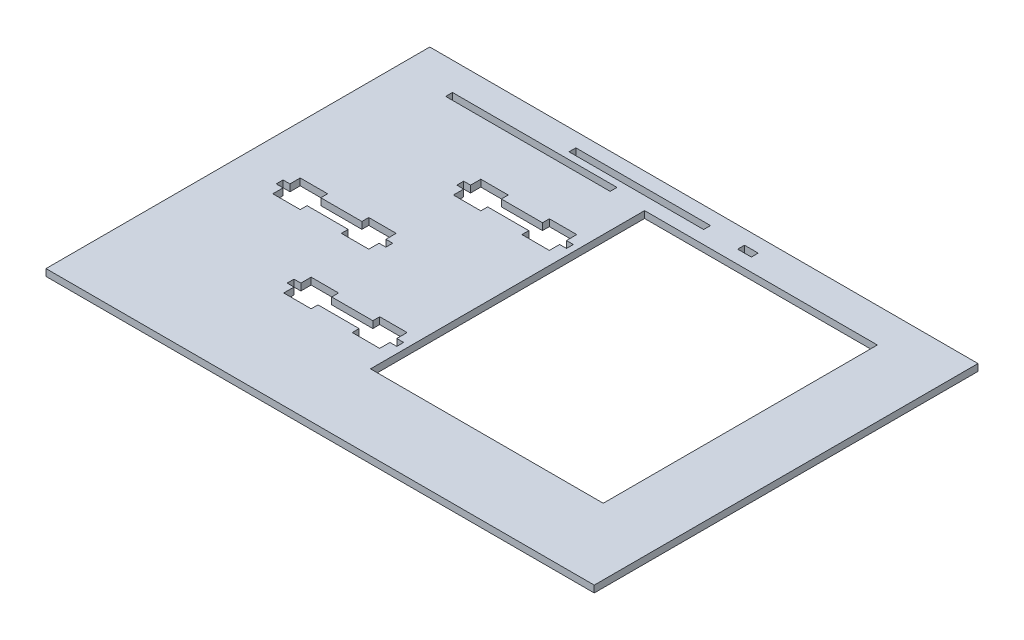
ISO-10303-21;
HEADER;
FILE_DESCRIPTION(('STEP AP214'),'2;1');
FILE_NAME('part.step','',(''),(''),'','','');
FILE_SCHEMA(('AUTOMOTIVE_DESIGN { 1 0 10303 214 1 1 1 1 }'));
ENDSEC;
DATA;
#1=APPLICATION_CONTEXT('core data for automotive mechanical design processes');
#2=APPLICATION_PROTOCOL_DEFINITION('international standard','automotive_design',2000,#1);
#3=PRODUCT_CONTEXT('',#1,'mechanical');
#4=PRODUCT('Part','Part','',(#3));
#5=PRODUCT_RELATED_PRODUCT_CATEGORY('part','',(#4));
#6=PRODUCT_DEFINITION_FORMATION('','',#4);
#7=PRODUCT_DEFINITION_CONTEXT('part definition',#1,'design');
#8=PRODUCT_DEFINITION('design','',#6,#7);
#9=PRODUCT_DEFINITION_SHAPE('','',#8);
#10=(LENGTH_UNIT() NAMED_UNIT(*) SI_UNIT(.MILLI.,.METRE.));
#11=(NAMED_UNIT(*) PLANE_ANGLE_UNIT() SI_UNIT($,.RADIAN.));
#12=(NAMED_UNIT(*) SI_UNIT($,.STERADIAN.) SOLID_ANGLE_UNIT());
#13=UNCERTAINTY_MEASURE_WITH_UNIT(LENGTH_MEASURE(1.E-05),#10,'distance_accuracy_value','');
#14=(GEOMETRIC_REPRESENTATION_CONTEXT(3) GLOBAL_UNCERTAINTY_ASSIGNED_CONTEXT((#13)) GLOBAL_UNIT_ASSIGNED_CONTEXT((#10,
#11,#12)) REPRESENTATION_CONTEXT('',''));
#15=CARTESIAN_POINT('',(0.,0.,0.));
#16=DIRECTION('',(0.,0.,1.));
#17=DIRECTION('',(1.,0.,0.));
#18=AXIS2_PLACEMENT_3D('',#15,#16,#17);
#19=CARTESIAN_POINT('',(127.,3.175,-88.9));
#20=DIRECTION('',(0.,-1.,0.));
#21=DIRECTION('',(0.,0.,-1.));
#22=AXIS2_PLACEMENT_3D('',#19,#20,#21);
#23=PLANE('',#22);
#24=DIRECTION('',(1.,0.,0.));
#25=VECTOR('',#24,1.);
#26=CARTESIAN_POINT('',(-11.5898587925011,3.175,53.975));
#27=LINE('',#26,#25);
#28=CARTESIAN_POINT('',(-11.5898587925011,3.175,53.975));
#29=VERTEX_POINT('',#28);
#30=CARTESIAN_POINT('',(96.2480587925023,3.175,53.975));
#31=VERTEX_POINT('',#30);
#32=EDGE_CURVE('E557',#29,#31,#27,.T.);
#33=ORIENTED_EDGE('',*,*,#32,.F.);
#34=DIRECTION('',(0.,0.,1.));
#35=VECTOR('',#34,1.);
#36=CARTESIAN_POINT('',(-11.5898587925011,3.175,-73.025));
#37=LINE('',#36,#35);
#38=CARTESIAN_POINT('',(-11.5898587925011,3.175,-73.025));
#39=VERTEX_POINT('',#38);
#40=EDGE_CURVE('E48',#39,#29,#37,.T.);
#41=ORIENTED_EDGE('',*,*,#40,.F.);
#42=DIRECTION('',(-1.,0.,0.));
#43=VECTOR('',#42,1.);
#44=CARTESIAN_POINT('',(-11.5898587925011,3.175,-73.025));
#45=LINE('',#44,#43);
#46=CARTESIAN_POINT('',(96.2480587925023,3.175,-73.025));
#47=VERTEX_POINT('',#46);
#48=EDGE_CURVE('E548',#47,#39,#45,.T.);
#49=ORIENTED_EDGE('',*,*,#48,.F.);
#50=DIRECTION('',(0.,0.,-1.));
#51=VECTOR('',#50,1.);
#52=CARTESIAN_POINT('',(96.2480587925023,3.175,-73.025));
#53=LINE('',#52,#51);
#54=EDGE_CURVE('E551',#31,#47,#53,.T.);
#55=ORIENTED_EDGE('',*,*,#54,.F.);
#56=EDGE_LOOP('',(#33,#41,#49,#55));
#57=FACE_BOUND('',#56,.T.);
#58=DIRECTION('',(-1.,0.,0.));
#59=VECTOR('',#58,1.);
#60=CARTESIAN_POINT('',(-17.683225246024,3.175,30.9220385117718));
#61=LINE('',#60,#59);
#62=CARTESIAN_POINT('',(-17.683225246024,3.175,30.9220385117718));
#63=VERTEX_POINT('',#62);
#64=CARTESIAN_POINT('',(-30.3832252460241,3.175,30.9220385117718));
#65=VERTEX_POINT('',#64);
#66=EDGE_CURVE('E563',#63,#65,#61,.T.);
#67=ORIENTED_EDGE('',*,*,#66,.F.);
#68=DIRECTION('',(0.,0.,-1.));
#69=VECTOR('',#68,1.);
#70=CARTESIAN_POINT('',(-17.683225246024,3.175,34.097038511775));
#71=LINE('',#70,#69);
#72=CARTESIAN_POINT('',(-17.683225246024,3.175,35.6845385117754));
#73=VERTEX_POINT('',#72);
#74=EDGE_CURVE('E571',#73,#63,#71,.T.);
#75=ORIENTED_EDGE('',*,*,#74,.F.);
#76=DIRECTION('',(-1.,0.,0.));
#77=VECTOR('',#76,1.);
#78=CARTESIAN_POINT('',(-14.5082252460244,3.175,35.6845385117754));
#79=LINE('',#78,#77);
#80=CARTESIAN_POINT('',(-14.5082252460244,3.175,35.6845385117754));
#81=VERTEX_POINT('',#80);
#82=EDGE_CURVE('E682',#81,#73,#79,.T.);
#83=ORIENTED_EDGE('',*,*,#82,.F.);
#84=DIRECTION('',(0.,0.,-1.));
#85=VECTOR('',#84,1.);
#86=CARTESIAN_POINT('',(-14.5082252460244,3.175,35.6845385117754));
#87=LINE('',#86,#85);
#88=CARTESIAN_POINT('',(-14.5082252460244,3.175,38.859538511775));
#89=VERTEX_POINT('',#88);
#90=EDGE_CURVE('E679',#89,#81,#87,.T.);
#91=ORIENTED_EDGE('',*,*,#90,.F.);
#92=DIRECTION('',(1.,0.,0.));
#93=VECTOR('',#92,1.);
#94=CARTESIAN_POINT('',(-14.5082252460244,3.175,38.859538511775));
#95=LINE('',#94,#93);
#96=CARTESIAN_POINT('',(-17.683225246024,3.175,38.859538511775));
#97=VERTEX_POINT('',#96);
#98=EDGE_CURVE('E676',#97,#89,#95,.T.);
#99=ORIENTED_EDGE('',*,*,#98,.F.);
#100=DIRECTION('',(0.,0.,-1.));
#101=VECTOR('',#100,1.);
#102=CARTESIAN_POINT('',(-17.683225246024,3.175,38.859538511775));
#103=LINE('',#102,#101);
#104=CARTESIAN_POINT('',(-17.683225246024,3.175,43.6220385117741));
#105=VERTEX_POINT('',#104);
#106=EDGE_CURVE('E673',#105,#97,#103,.T.);
#107=ORIENTED_EDGE('',*,*,#106,.F.);
#108=DIRECTION('',(1.,0.,0.));
#109=VECTOR('',#108,1.);
#110=CARTESIAN_POINT('',(-17.683225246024,3.175,43.6220385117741));
#111=LINE('',#110,#109);
#112=CARTESIAN_POINT('',(-30.3832252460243,3.175,43.6220385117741));
#113=VERTEX_POINT('',#112);
#114=EDGE_CURVE('E670',#113,#105,#111,.T.);
#115=ORIENTED_EDGE('',*,*,#114,.F.);
#116=DIRECTION('',(0.,0.,1.));
#117=VECTOR('',#116,1.);
#118=CARTESIAN_POINT('',(-30.3832252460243,3.175,40.4470385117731));
#119=LINE('',#118,#117);
#120=CARTESIAN_POINT('',(-30.3832252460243,3.175,40.4470385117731));
#121=VERTEX_POINT('',#120);
#122=EDGE_CURVE('E667',#121,#113,#119,.T.);
#123=ORIENTED_EDGE('',*,*,#122,.F.);
#124=DIRECTION('',(1.,0.,0.));
#125=VECTOR('',#124,1.);
#126=CARTESIAN_POINT('',(-49.4332252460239,3.175,40.4470385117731));
#127=LINE('',#126,#125);
#128=CARTESIAN_POINT('',(-49.4332252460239,3.175,40.4470385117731));
#129=VERTEX_POINT('',#128);
#130=EDGE_CURVE('E664',#129,#121,#127,.T.);
#131=ORIENTED_EDGE('',*,*,#130,.F.);
#132=DIRECTION('',(0.,0.,-1.));
#133=VECTOR('',#132,1.);
#134=CARTESIAN_POINT('',(-49.4332252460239,3.175,40.4470385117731));
#135=LINE('',#134,#133);
#136=CARTESIAN_POINT('',(-49.4332252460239,3.175,43.6220385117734));
#137=VERTEX_POINT('',#136);
#138=EDGE_CURVE('E661',#137,#129,#135,.T.);
#139=ORIENTED_EDGE('',*,*,#138,.F.);
#140=DIRECTION('',(1.,0.,0.));
#141=VECTOR('',#140,1.);
#142=CARTESIAN_POINT('',(-49.4332252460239,3.175,43.6220385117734));
#143=LINE('',#142,#141);
#144=CARTESIAN_POINT('',(-62.1332252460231,3.175,43.6220385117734));
#145=VERTEX_POINT('',#144);
#146=EDGE_CURVE('E658',#145,#137,#143,.T.);
#147=ORIENTED_EDGE('',*,*,#146,.F.);
#148=DIRECTION('',(0.,0.,1.));
#149=VECTOR('',#148,1.);
#150=CARTESIAN_POINT('',(-62.1332252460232,3.175,40.447038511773));
#151=LINE('',#150,#149);
#152=CARTESIAN_POINT('',(-62.1332252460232,3.175,38.8595385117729));
#153=VERTEX_POINT('',#152);
#154=EDGE_CURVE('E655',#153,#145,#151,.T.);
#155=ORIENTED_EDGE('',*,*,#154,.F.);
#156=DIRECTION('',(1.,0.,0.));
#157=VECTOR('',#156,1.);
#158=CARTESIAN_POINT('',(-62.1332252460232,3.175,38.8595385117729));
#159=LINE('',#158,#157);
#160=CARTESIAN_POINT('',(-65.3082252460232,3.175,38.8595385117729));
#161=VERTEX_POINT('',#160);
#162=EDGE_CURVE('E652',#161,#153,#159,.T.);
#163=ORIENTED_EDGE('',*,*,#162,.F.);
#164=DIRECTION('',(0.,0.,1.));
#165=VECTOR('',#164,1.);
#166=CARTESIAN_POINT('',(-65.3082252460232,3.175,35.6845385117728));
#167=LINE('',#166,#165);
#168=CARTESIAN_POINT('',(-65.3082252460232,3.175,35.6845385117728));
#169=VERTEX_POINT('',#168);
#170=EDGE_CURVE('E649',#169,#161,#167,.T.);
#171=ORIENTED_EDGE('',*,*,#170,.F.);
#172=DIRECTION('',(-1.,0.,0.));
#173=VECTOR('',#172,1.);
#174=CARTESIAN_POINT('',(-62.1332252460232,3.175,35.6845385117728));
#175=LINE('',#174,#173);
#176=CARTESIAN_POINT('',(-62.1332252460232,3.175,35.6845385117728));
#177=VERTEX_POINT('',#176);
#178=EDGE_CURVE('E646',#177,#169,#175,.T.);
#179=ORIENTED_EDGE('',*,*,#178,.F.);
#180=DIRECTION('',(0.,0.,1.));
#181=VECTOR('',#180,1.);
#182=CARTESIAN_POINT('',(-62.1332252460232,3.175,34.097038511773));
#183=LINE('',#182,#181);
#184=CARTESIAN_POINT('',(-62.1332252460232,3.175,30.9220385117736));
#185=VERTEX_POINT('',#184);
#186=EDGE_CURVE('E643',#185,#177,#183,.T.);
#187=ORIENTED_EDGE('',*,*,#186,.F.);
#188=DIRECTION('',(-1.,0.,0.));
#189=VECTOR('',#188,1.);
#190=CARTESIAN_POINT('',(-49.4332252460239,3.175,30.9220385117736));
#191=LINE('',#190,#189);
#192=CARTESIAN_POINT('',(-49.4332252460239,3.175,30.9220385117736));
#193=VERTEX_POINT('',#192);
#194=EDGE_CURVE('E640',#193,#185,#191,.T.);
#195=ORIENTED_EDGE('',*,*,#194,.F.);
#196=DIRECTION('',(0.,0.,-1.));
#197=VECTOR('',#196,1.);
#198=CARTESIAN_POINT('',(-49.4332252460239,3.175,30.9220385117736));
#199=LINE('',#198,#197);
#200=CARTESIAN_POINT('',(-49.4332252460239,3.175,34.097038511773));
#201=VERTEX_POINT('',#200);
#202=EDGE_CURVE('E637',#201,#193,#199,.T.);
#203=ORIENTED_EDGE('',*,*,#202,.F.);
#204=DIRECTION('',(-1.,0.,0.));
#205=VECTOR('',#204,1.);
#206=CARTESIAN_POINT('',(-49.4332252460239,3.175,34.097038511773));
#207=LINE('',#206,#205);
#208=CARTESIAN_POINT('',(-30.3832252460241,3.175,34.097038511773));
#209=VERTEX_POINT('',#208);
#210=EDGE_CURVE('E634',#209,#201,#207,.T.);
#211=ORIENTED_EDGE('',*,*,#210,.F.);
#212=DIRECTION('',(0.,0.,1.));
#213=VECTOR('',#212,1.);
#214=CARTESIAN_POINT('',(-30.3832252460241,3.175,30.9220385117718));
#215=LINE('',#214,#213);
#216=EDGE_CURVE('E631',#65,#209,#215,.T.);
#217=ORIENTED_EDGE('',*,*,#216,.F.);
#218=EDGE_LOOP('',(#67,#75,#83,#91,#99,#107,#115,#123,#131,#139,#147,#155,#163,#171,#179,#187,
#195,#203,#211,#217));
#219=FACE_BOUND('',#218,.T.);
#220=DIRECTION('',(0.,0.,1.));
#221=VECTOR('',#220,1.);
#222=CARTESIAN_POINT('',(-30.3832252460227,3.175,-47.6867085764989));
#223=LINE('',#222,#221);
#224=CARTESIAN_POINT('',(-30.3832252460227,3.175,-47.6867085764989));
#225=VERTEX_POINT('',#224);
#226=CARTESIAN_POINT('',(-30.3832252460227,3.175,-44.5117085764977));
#227=VERTEX_POINT('',#226);
#228=EDGE_CURVE('E790',#225,#227,#223,.T.);
#229=ORIENTED_EDGE('',*,*,#228,.F.);
#230=DIRECTION('',(-1.,0.,0.));
#231=VECTOR('',#230,1.);
#232=CARTESIAN_POINT('',(-17.6832252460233,3.175,-47.6867085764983));
#233=LINE('',#232,#231);
#234=CARTESIAN_POINT('',(-17.6832252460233,3.175,-47.6867085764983));
#235=VERTEX_POINT('',#234);
#236=EDGE_CURVE('E689',#235,#225,#233,.T.);
#237=ORIENTED_EDGE('',*,*,#236,.F.);
#238=DIRECTION('',(0.,0.,-1.));
#239=VECTOR('',#238,1.);
#240=CARTESIAN_POINT('',(-17.6832252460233,3.175,-44.5117085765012));
#241=LINE('',#240,#239);
#242=CARTESIAN_POINT('',(-17.6832252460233,3.175,-42.9242085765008));
#243=VERTEX_POINT('',#242);
#244=EDGE_CURVE('E731',#243,#235,#241,.T.);
#245=ORIENTED_EDGE('',*,*,#244,.F.);
#246=DIRECTION('',(-1.,0.,0.));
#247=VECTOR('',#246,1.);
#248=CARTESIAN_POINT('',(-14.5082252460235,3.175,-42.9242085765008));
#249=LINE('',#248,#247);
#250=CARTESIAN_POINT('',(-14.5082252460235,3.175,-42.9242085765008));
#251=VERTEX_POINT('',#250);
#252=EDGE_CURVE('E841',#251,#243,#249,.T.);
#253=ORIENTED_EDGE('',*,*,#252,.F.);
#254=DIRECTION('',(0.,0.,-1.));
#255=VECTOR('',#254,1.);
#256=CARTESIAN_POINT('',(-14.5082252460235,3.175,-42.9242085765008));
#257=LINE('',#256,#255);
#258=CARTESIAN_POINT('',(-14.5082252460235,3.175,-39.749208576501));
#259=VERTEX_POINT('',#258);
#260=EDGE_CURVE('E838',#259,#251,#257,.T.);
#261=ORIENTED_EDGE('',*,*,#260,.F.);
#262=DIRECTION('',(1.,0.,0.));
#263=VECTOR('',#262,1.);
#264=CARTESIAN_POINT('',(-14.5082252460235,3.175,-39.749208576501));
#265=LINE('',#264,#263);
#266=CARTESIAN_POINT('',(-17.6832252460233,3.175,-39.749208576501));
#267=VERTEX_POINT('',#266);
#268=EDGE_CURVE('E835',#267,#259,#265,.T.);
#269=ORIENTED_EDGE('',*,*,#268,.F.);
#270=DIRECTION('',(0.,0.,-1.));
#271=VECTOR('',#270,1.);
#272=CARTESIAN_POINT('',(-17.6832252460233,3.175,-39.749208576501));
#273=LINE('',#272,#271);
#274=CARTESIAN_POINT('',(-17.6832252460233,3.175,-34.9867085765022));
#275=VERTEX_POINT('',#274);
#276=EDGE_CURVE('E832',#275,#267,#273,.T.);
#277=ORIENTED_EDGE('',*,*,#276,.F.);
#278=DIRECTION('',(1.,0.,0.));
#279=VECTOR('',#278,1.);
#280=CARTESIAN_POINT('',(-17.6832252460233,3.175,-34.9867085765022));
#281=LINE('',#280,#279);
#282=CARTESIAN_POINT('',(-30.3832252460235,3.175,-34.9867085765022));
#283=VERTEX_POINT('',#282);
#284=EDGE_CURVE('E829',#283,#275,#281,.T.);
#285=ORIENTED_EDGE('',*,*,#284,.F.);
#286=DIRECTION('',(0.,0.,1.));
#287=VECTOR('',#286,1.);
#288=CARTESIAN_POINT('',(-30.3832252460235,3.175,-38.1617085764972));
#289=LINE('',#288,#287);
#290=CARTESIAN_POINT('',(-30.3832252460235,3.175,-38.1617085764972));
#291=VERTEX_POINT('',#290);
#292=EDGE_CURVE('E826',#291,#283,#289,.T.);
#293=ORIENTED_EDGE('',*,*,#292,.F.);
#294=DIRECTION('',(1.,0.,0.));
#295=VECTOR('',#294,1.);
#296=CARTESIAN_POINT('',(-49.4332252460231,3.175,-38.1617085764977));
#297=LINE('',#296,#295);
#298=CARTESIAN_POINT('',(-49.4332252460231,3.175,-38.1617085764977));
#299=VERTEX_POINT('',#298);
#300=EDGE_CURVE('E823',#299,#291,#297,.T.);
#301=ORIENTED_EDGE('',*,*,#300,.F.);
#302=DIRECTION('',(0.,0.,-1.));
#303=VECTOR('',#302,1.);
#304=CARTESIAN_POINT('',(-49.4332252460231,3.175,-38.1617085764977));
#305=LINE('',#304,#303);
#306=CARTESIAN_POINT('',(-49.4332252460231,3.175,-34.9867085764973));
#307=VERTEX_POINT('',#306);
#308=EDGE_CURVE('E820',#307,#299,#305,.T.);
#309=ORIENTED_EDGE('',*,*,#308,.F.);
#310=DIRECTION('',(1.,0.,0.));
#311=VECTOR('',#310,1.);
#312=CARTESIAN_POINT('',(-49.4332252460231,3.175,-34.9867085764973));
#313=LINE('',#312,#311);
#314=CARTESIAN_POINT('',(-62.1332252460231,3.175,-34.9867085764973));
#315=VERTEX_POINT('',#314);
#316=EDGE_CURVE('E817',#315,#307,#313,.T.);
#317=ORIENTED_EDGE('',*,*,#316,.F.);
#318=DIRECTION('',(0.,0.,1.));
#319=VECTOR('',#318,1.);
#320=CARTESIAN_POINT('',(-62.1332252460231,3.175,-38.1617085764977));
#321=LINE('',#320,#319);
#322=CARTESIAN_POINT('',(-62.1332252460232,3.175,-39.7492085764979));
#323=VERTEX_POINT('',#322);
#324=EDGE_CURVE('E814',#323,#315,#321,.T.);
#325=ORIENTED_EDGE('',*,*,#324,.F.);
#326=DIRECTION('',(1.,0.,0.));
#327=VECTOR('',#326,1.);
#328=CARTESIAN_POINT('',(-62.1332252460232,3.175,-39.7492085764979));
#329=LINE('',#328,#327);
#330=CARTESIAN_POINT('',(-65.3082252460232,3.175,-39.7492085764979));
#331=VERTEX_POINT('',#330);
#332=EDGE_CURVE('E811',#331,#323,#329,.T.);
#333=ORIENTED_EDGE('',*,*,#332,.F.);
#334=DIRECTION('',(0.,0.,1.));
#335=VECTOR('',#334,1.);
#336=CARTESIAN_POINT('',(-65.3082252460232,3.175,-42.9242085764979));
#337=LINE('',#336,#335);
#338=CARTESIAN_POINT('',(-65.3082252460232,3.175,-42.9242085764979));
#339=VERTEX_POINT('',#338);
#340=EDGE_CURVE('E808',#339,#331,#337,.T.);
#341=ORIENTED_EDGE('',*,*,#340,.F.);
#342=DIRECTION('',(-1.,0.,0.));
#343=VECTOR('',#342,1.);
#344=CARTESIAN_POINT('',(-62.1332252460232,3.175,-42.9242085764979));
#345=LINE('',#344,#343);
#346=CARTESIAN_POINT('',(-62.1332252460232,3.175,-42.9242085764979));
#347=VERTEX_POINT('',#346);
#348=EDGE_CURVE('E805',#347,#339,#345,.T.);
#349=ORIENTED_EDGE('',*,*,#348,.F.);
#350=DIRECTION('',(0.,0.,1.));
#351=VECTOR('',#350,1.);
#352=CARTESIAN_POINT('',(-62.1332252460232,3.175,-44.5117085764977));
#353=LINE('',#352,#351);
#354=CARTESIAN_POINT('',(-62.1332252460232,3.175,-47.6867085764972));
#355=VERTEX_POINT('',#354);
#356=EDGE_CURVE('E802',#355,#347,#353,.T.);
#357=ORIENTED_EDGE('',*,*,#356,.F.);
#358=DIRECTION('',(-1.,0.,0.));
#359=VECTOR('',#358,1.);
#360=CARTESIAN_POINT('',(-49.4332252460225,3.175,-47.6867085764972));
#361=LINE('',#360,#359);
#362=CARTESIAN_POINT('',(-49.4332252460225,3.175,-47.6867085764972));
#363=VERTEX_POINT('',#362);
#364=EDGE_CURVE('E799',#363,#355,#361,.T.);
#365=ORIENTED_EDGE('',*,*,#364,.F.);
#366=DIRECTION('',(0.,0.,-1.));
#367=VECTOR('',#366,1.);
#368=CARTESIAN_POINT('',(-49.4332252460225,3.175,-47.6867085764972));
#369=LINE('',#368,#367);
#370=CARTESIAN_POINT('',(-49.4332252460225,3.175,-44.5117085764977));
#371=VERTEX_POINT('',#370);
#372=EDGE_CURVE('E796',#371,#363,#369,.T.);
#373=ORIENTED_EDGE('',*,*,#372,.F.);
#374=DIRECTION('',(-1.,0.,0.));
#375=VECTOR('',#374,1.);
#376=CARTESIAN_POINT('',(-49.4332252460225,3.175,-44.5117085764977));
#377=LINE('',#376,#375);
#378=EDGE_CURVE('E793',#227,#371,#377,.T.);
#379=ORIENTED_EDGE('',*,*,#378,.F.);
#380=EDGE_LOOP('',(#229,#237,#245,#253,#261,#269,#277,#285,#293,#301,#309,#317,#325,#333,#341,
#349,#357,#365,#373,#379));
#381=FACE_BOUND('',#380,.T.);
#382=DIRECTION('',(-1.,0.,0.));
#383=VECTOR('',#382,1.);
#384=CARTESIAN_POINT('',(-60.0165584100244,3.175,-6.35000000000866));
#385=LINE('',#384,#383);
#386=CARTESIAN_POINT('',(-60.0165584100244,3.175,-6.35000000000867));
#387=VERTEX_POINT('',#386);
#388=CARTESIAN_POINT('',(-72.7165584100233,3.175,-6.35000000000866));
#389=VERTEX_POINT('',#388);
#390=EDGE_CURVE('E848',#387,#389,#385,.T.);
#391=ORIENTED_EDGE('',*,*,#390,.F.);
#392=DIRECTION('',(0.,0.,-1.));
#393=VECTOR('',#392,1.);
#394=CARTESIAN_POINT('',(-60.0165584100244,3.175,-3.17500000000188));
#395=LINE('',#394,#393);
#396=CARTESIAN_POINT('',(-60.0165584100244,3.175,-1.58750000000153));
#397=VERTEX_POINT('',#396);
#398=EDGE_CURVE('E891',#397,#387,#395,.T.);
#399=ORIENTED_EDGE('',*,*,#398,.F.);
#400=DIRECTION('',(-1.,0.,0.));
#401=VECTOR('',#400,1.);
#402=CARTESIAN_POINT('',(-56.8415584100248,3.175,-1.58750000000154));
#403=LINE('',#402,#401);
#404=CARTESIAN_POINT('',(-56.8415584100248,3.175,-1.58750000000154));
#405=VERTEX_POINT('',#404);
#406=EDGE_CURVE('E1002',#405,#397,#403,.T.);
#407=ORIENTED_EDGE('',*,*,#406,.F.);
#408=DIRECTION('',(0.,0.,-1.));
#409=VECTOR('',#408,1.);
#410=CARTESIAN_POINT('',(-56.8415584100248,3.175,-1.58750000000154));
#411=LINE('',#410,#409);
#412=CARTESIAN_POINT('',(-56.8415584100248,3.175,1.58749999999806));
#413=VERTEX_POINT('',#412);
#414=EDGE_CURVE('E999',#413,#405,#411,.T.);
#415=ORIENTED_EDGE('',*,*,#414,.F.);
#416=DIRECTION('',(1.,0.,0.));
#417=VECTOR('',#416,1.);
#418=CARTESIAN_POINT('',(-56.8415584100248,3.175,1.58749999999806));
#419=LINE('',#418,#417);
#420=CARTESIAN_POINT('',(-60.0165584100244,3.175,1.58749999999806));
#421=VERTEX_POINT('',#420);
#422=EDGE_CURVE('E996',#421,#413,#419,.T.);
#423=ORIENTED_EDGE('',*,*,#422,.F.);
#424=DIRECTION('',(0.,0.,-1.));
#425=VECTOR('',#424,1.);
#426=CARTESIAN_POINT('',(-60.0165584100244,3.175,1.58749999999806));
#427=LINE('',#426,#425);
#428=CARTESIAN_POINT('',(-60.0165584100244,3.175,6.34999999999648));
#429=VERTEX_POINT('',#428);
#430=EDGE_CURVE('E993',#429,#421,#427,.T.);
#431=ORIENTED_EDGE('',*,*,#430,.F.);
#432=DIRECTION('',(1.,0.,0.));
#433=VECTOR('',#432,1.);
#434=CARTESIAN_POINT('',(-60.0165584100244,3.175,6.34999999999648));
#435=LINE('',#434,#433);
#436=CARTESIAN_POINT('',(-72.7165584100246,3.175,6.34999999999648));
#437=VERTEX_POINT('',#436);
#438=EDGE_CURVE('E990',#437,#429,#435,.T.);
#439=ORIENTED_EDGE('',*,*,#438,.F.);
#440=DIRECTION('',(0.,0.,1.));
#441=VECTOR('',#440,1.);
#442=CARTESIAN_POINT('',(-72.7165584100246,3.175,3.17499999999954));
#443=LINE('',#442,#441);
#444=CARTESIAN_POINT('',(-72.7165584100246,3.175,3.17499999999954));
#445=VERTEX_POINT('',#444);
#446=EDGE_CURVE('E987',#445,#437,#443,.T.);
#447=ORIENTED_EDGE('',*,*,#446,.F.);
#448=DIRECTION('',(1.,0.,0.));
#449=VECTOR('',#448,1.);
#450=CARTESIAN_POINT('',(-91.7665584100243,3.175,3.17499999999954));
#451=LINE('',#450,#449);
#452=CARTESIAN_POINT('',(-91.7665584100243,3.175,3.17499999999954));
#453=VERTEX_POINT('',#452);
#454=EDGE_CURVE('E984',#453,#445,#451,.T.);
#455=ORIENTED_EDGE('',*,*,#454,.F.);
#456=DIRECTION('',(0.,0.,-1.));
#457=VECTOR('',#456,1.);
#458=CARTESIAN_POINT('',(-91.7665584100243,3.175,3.17499999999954));
#459=LINE('',#458,#457);
#460=CARTESIAN_POINT('',(-91.7665584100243,3.175,6.34999999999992));
#461=VERTEX_POINT('',#460);
#462=EDGE_CURVE('E981',#461,#453,#459,.T.);
#463=ORIENTED_EDGE('',*,*,#462,.F.);
#464=DIRECTION('',(1.,0.,0.));
#465=VECTOR('',#464,1.);
#466=CARTESIAN_POINT('',(-91.7665584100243,3.175,6.34999999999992));
#467=LINE('',#466,#465);
#468=CARTESIAN_POINT('',(-104.466558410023,3.175,6.34999999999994));
#469=VERTEX_POINT('',#468);
#470=EDGE_CURVE('E978',#469,#461,#467,.T.);
#471=ORIENTED_EDGE('',*,*,#470,.F.);
#472=DIRECTION('',(0.,0.,1.));
#473=VECTOR('',#472,1.);
#474=CARTESIAN_POINT('',(-104.466558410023,3.175,3.17499999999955));
#475=LINE('',#474,#473);
#476=CARTESIAN_POINT('',(-104.466558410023,3.175,1.58749999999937));
#477=VERTEX_POINT('',#476);
#478=EDGE_CURVE('E975',#477,#469,#475,.T.);
#479=ORIENTED_EDGE('',*,*,#478,.F.);
#480=DIRECTION('',(1.,0.,0.));
#481=VECTOR('',#480,1.);
#482=CARTESIAN_POINT('',(-104.466558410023,3.175,1.58749999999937));
#483=LINE('',#482,#481);
#484=CARTESIAN_POINT('',(-107.641558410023,3.175,1.58749999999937));
#485=VERTEX_POINT('',#484);
#486=EDGE_CURVE('E972',#485,#477,#483,.T.);
#487=ORIENTED_EDGE('',*,*,#486,.F.);
#488=DIRECTION('',(0.,0.,1.));
#489=VECTOR('',#488,1.);
#490=CARTESIAN_POINT('',(-107.641558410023,3.175,-1.58750000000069));
#491=LINE('',#490,#489);
#492=CARTESIAN_POINT('',(-107.641558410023,3.175,-1.58750000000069));
#493=VERTEX_POINT('',#492);
#494=EDGE_CURVE('E969',#493,#485,#491,.T.);
#495=ORIENTED_EDGE('',*,*,#494,.F.);
#496=DIRECTION('',(-1.,0.,0.));
#497=VECTOR('',#496,1.);
#498=CARTESIAN_POINT('',(-104.466558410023,3.175,-1.58750000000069));
#499=LINE('',#498,#497);
#500=CARTESIAN_POINT('',(-104.466558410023,3.175,-1.58750000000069));
#501=VERTEX_POINT('',#500);
#502=EDGE_CURVE('E966',#501,#493,#499,.T.);
#503=ORIENTED_EDGE('',*,*,#502,.F.);
#504=DIRECTION('',(0.,0.,1.));
#505=VECTOR('',#504,1.);
#506=CARTESIAN_POINT('',(-104.466558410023,3.175,-3.17500000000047));
#507=LINE('',#506,#505);
#508=CARTESIAN_POINT('',(-104.466558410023,3.175,-6.34999999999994));
#509=VERTEX_POINT('',#508);
#510=EDGE_CURVE('E963',#509,#501,#507,.T.);
#511=ORIENTED_EDGE('',*,*,#510,.F.);
#512=DIRECTION('',(-1.,0.,0.));
#513=VECTOR('',#512,1.);
#514=CARTESIAN_POINT('',(-91.7665584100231,3.175,-6.34999999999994));
#515=LINE('',#514,#513);
#516=CARTESIAN_POINT('',(-91.7665584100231,3.175,-6.34999999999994));
#517=VERTEX_POINT('',#516);
#518=EDGE_CURVE('E960',#517,#509,#515,.T.);
#519=ORIENTED_EDGE('',*,*,#518,.F.);
#520=DIRECTION('',(0.,0.,-1.));
#521=VECTOR('',#520,1.);
#522=CARTESIAN_POINT('',(-91.7665584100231,3.175,-6.34999999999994));
#523=LINE('',#522,#521);
#524=CARTESIAN_POINT('',(-91.7665584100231,3.175,-3.17500000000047));
#525=VERTEX_POINT('',#524);
#526=EDGE_CURVE('E957',#525,#517,#523,.T.);
#527=ORIENTED_EDGE('',*,*,#526,.F.);
#528=DIRECTION('',(-1.,0.,0.));
#529=VECTOR('',#528,1.);
#530=CARTESIAN_POINT('',(-91.7665584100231,3.175,-3.17500000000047));
#531=LINE('',#530,#529);
#532=CARTESIAN_POINT('',(-72.7165584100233,3.175,-3.17499999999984));
#533=VERTEX_POINT('',#532);
#534=EDGE_CURVE('E954',#533,#525,#531,.T.);
#535=ORIENTED_EDGE('',*,*,#534,.F.);
#536=DIRECTION('',(0.,0.,1.));
#537=VECTOR('',#536,1.);
#538=CARTESIAN_POINT('',(-72.7165584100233,3.175,-6.35000000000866));
#539=LINE('',#538,#537);
#540=EDGE_CURVE('E951',#389,#533,#539,.T.);
#541=ORIENTED_EDGE('',*,*,#540,.F.);
#542=EDGE_LOOP('',(#391,#399,#407,#415,#423,#431,#439,#447,#455,#463,#471,#479,#487,#495,#503,
#511,#519,#527,#535,#541));
#543=FACE_BOUND('',#542,.T.);
#544=DIRECTION('',(1.,0.,0.));
#545=VECTOR('',#544,1.);
#546=CARTESIAN_POINT('',(-52.6990117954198,3.175,-79.1103063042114));
#547=LINE('',#546,#545);
#548=CARTESIAN_POINT('',(-52.6990117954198,3.175,-79.1103063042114));
#549=VERTEX_POINT('',#548);
#550=CARTESIAN_POINT('',(9.67022493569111,3.175,-79.1103063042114));
#551=VERTEX_POINT('',#550);
#552=EDGE_CURVE('E1062',#549,#551,#547,.T.);
#553=ORIENTED_EDGE('',*,*,#552,.F.);
#554=DIRECTION('',(0.,0.,1.));
#555=VECTOR('',#554,1.);
#556=CARTESIAN_POINT('',(-52.6990117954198,3.175,-79.1103063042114));
#557=LINE('',#556,#555);
#558=CARTESIAN_POINT('',(-52.6990117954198,3.175,-82.2853063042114));
#559=VERTEX_POINT('',#558);
#560=EDGE_CURVE('E1009',#559,#549,#557,.T.);
#561=ORIENTED_EDGE('',*,*,#560,.F.);
#562=DIRECTION('',(-1.,0.,0.));
#563=VECTOR('',#562,1.);
#564=CARTESIAN_POINT('',(-52.6990117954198,3.175,-82.2853063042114));
#565=LINE('',#564,#563);
#566=CARTESIAN_POINT('',(9.67022493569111,3.175,-82.2853063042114));
#567=VERTEX_POINT('',#566);
#568=EDGE_CURVE('E1051',#567,#559,#565,.T.);
#569=ORIENTED_EDGE('',*,*,#568,.F.);
#570=DIRECTION('',(0.,0.,-1.));
#571=VECTOR('',#570,1.);
#572=CARTESIAN_POINT('',(9.67022493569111,3.175,-79.1103063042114));
#573=LINE('',#572,#571);
#574=EDGE_CURVE('E1065',#551,#567,#573,.T.);
#575=ORIENTED_EDGE('',*,*,#574,.F.);
#576=EDGE_LOOP('',(#553,#561,#569,#575));
#577=FACE_BOUND('',#576,.T.);
#578=DIRECTION('',(-1.,0.,0.));
#579=VECTOR('',#578,1.);
#580=CARTESIAN_POINT('',(-103.49901179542,3.175,-75.9353063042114));
#581=LINE('',#580,#579);
#582=CARTESIAN_POINT('',(-27.2990117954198,3.175,-75.9353063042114));
#583=VERTEX_POINT('',#582);
#584=CARTESIAN_POINT('',(-103.49901179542,3.175,-75.9353063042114));
#585=VERTEX_POINT('',#584);
#586=EDGE_CURVE('E1094',#583,#585,#581,.T.);
#587=ORIENTED_EDGE('',*,*,#586,.F.);
#588=DIRECTION('',(0.,0.,-1.));
#589=VECTOR('',#588,1.);
#590=CARTESIAN_POINT('',(-27.2990117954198,3.175,-75.9353063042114));
#591=LINE('',#590,#589);
#592=CARTESIAN_POINT('',(-27.2990117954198,3.175,-72.7603063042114));
#593=VERTEX_POINT('',#592);
#594=EDGE_CURVE('E1072',#593,#583,#591,.T.);
#595=ORIENTED_EDGE('',*,*,#594,.F.);
#596=DIRECTION('',(1.,0.,0.));
#597=VECTOR('',#596,1.);
#598=CARTESIAN_POINT('',(-103.49901179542,3.175,-72.7603063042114));
#599=LINE('',#598,#597);
#600=CARTESIAN_POINT('',(-103.49901179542,3.175,-72.7603063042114));
#601=VERTEX_POINT('',#600);
#602=EDGE_CURVE('E1083',#601,#593,#599,.T.);
#603=ORIENTED_EDGE('',*,*,#602,.F.);
#604=DIRECTION('',(0.,0.,1.));
#605=VECTOR('',#604,1.);
#606=CARTESIAN_POINT('',(-103.49901179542,3.175,-75.9353063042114));
#607=LINE('',#606,#605);
#608=EDGE_CURVE('E1097',#585,#601,#607,.T.);
#609=ORIENTED_EDGE('',*,*,#608,.F.);
#610=EDGE_LOOP('',(#587,#595,#603,#609));
#611=FACE_BOUND('',#610,.T.);
#612=DIRECTION('',(1.,0.,0.));
#613=VECTOR('',#612,1.);
#614=CARTESIAN_POINT('',(25.4343501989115,3.175,-79.1103063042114));
#615=LINE('',#614,#613);
#616=CARTESIAN_POINT('',(25.4343501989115,3.175,-79.1103063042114));
#617=VERTEX_POINT('',#616);
#618=CARTESIAN_POINT('',(31.7843501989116,3.175,-79.1103063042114));
#619=VERTEX_POINT('',#618);
#620=EDGE_CURVE('E1126',#617,#619,#615,.T.);
#621=ORIENTED_EDGE('',*,*,#620,.F.);
#622=DIRECTION('',(0.,0.,1.));
#623=VECTOR('',#622,1.);
#624=CARTESIAN_POINT('',(25.4343501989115,3.175,-79.1103063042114));
#625=LINE('',#624,#623);
#626=CARTESIAN_POINT('',(25.4343501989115,3.175,-82.2853063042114));
#627=VERTEX_POINT('',#626);
#628=EDGE_CURVE('E1104',#627,#617,#625,.T.);
#629=ORIENTED_EDGE('',*,*,#628,.F.);
#630=DIRECTION('',(-1.,0.,0.));
#631=VECTOR('',#630,1.);
#632=CARTESIAN_POINT('',(25.4343501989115,3.175,-82.2853063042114));
#633=LINE('',#632,#631);
#634=CARTESIAN_POINT('',(31.7843501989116,3.175,-82.2853063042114));
#635=VERTEX_POINT('',#634);
#636=EDGE_CURVE('E1115',#635,#627,#633,.T.);
#637=ORIENTED_EDGE('',*,*,#636,.F.);
#638=DIRECTION('',(0.,0.,-1.));
#639=VECTOR('',#638,1.);
#640=CARTESIAN_POINT('',(31.7843501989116,3.175,-79.1103063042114));
#641=LINE('',#640,#639);
#642=EDGE_CURVE('E1129',#619,#635,#641,.T.);
#643=ORIENTED_EDGE('',*,*,#642,.F.);
#644=EDGE_LOOP('',(#621,#629,#637,#643));
#645=FACE_BOUND('',#644,.T.);
#646=DIRECTION('',(0.,0.,-1.));
#647=VECTOR('',#646,1.);
#648=CARTESIAN_POINT('',(127.,3.175,88.9));
#649=LINE('',#648,#647);
#650=CARTESIAN_POINT('',(127.,3.175,88.9));
#651=VERTEX_POINT('',#650);
#652=CARTESIAN_POINT('',(127.,3.175,-88.9));
#653=VERTEX_POINT('',#652);
#654=EDGE_CURVE('E1143',#651,#653,#649,.T.);
#655=ORIENTED_EDGE('',*,*,#654,.T.);
#656=DIRECTION('',(-1.,0.,0.));
#657=VECTOR('',#656,1.);
#658=CARTESIAN_POINT('',(-127.,3.175,-88.9));
#659=LINE('',#658,#657);
#660=CARTESIAN_POINT('',(-127.,3.175,-88.9));
#661=VERTEX_POINT('',#660);
#662=EDGE_CURVE('E1146',#653,#661,#659,.T.);
#663=ORIENTED_EDGE('',*,*,#662,.T.);
#664=DIRECTION('',(0.,0.,1.));
#665=VECTOR('',#664,1.);
#666=CARTESIAN_POINT('',(-127.,3.175,88.9));
#667=LINE('',#666,#665);
#668=CARTESIAN_POINT('',(-127.,3.175,88.9));
#669=VERTEX_POINT('',#668);
#670=EDGE_CURVE('E1149',#661,#669,#667,.T.);
#671=ORIENTED_EDGE('',*,*,#670,.T.);
#672=DIRECTION('',(1.,0.,0.));
#673=VECTOR('',#672,1.);
#674=CARTESIAN_POINT('',(-127.,3.175,88.9));
#675=LINE('',#674,#673);
#676=EDGE_CURVE('E1151',#669,#651,#675,.T.);
#677=ORIENTED_EDGE('',*,*,#676,.T.);
#678=EDGE_LOOP('',(#655,#663,#671,#677));
#679=FACE_BOUND('',#678,.T.);
#680=ADVANCED_FACE('F33',(#57,#219,#381,#543,#577,#611,#645,#679),#23,.F.);
#681=CARTESIAN_POINT('',(127.,0.,-88.9));
#682=DIRECTION('',(0.,-1.,0.));
#683=DIRECTION('',(0.,0.,-1.));
#684=AXIS2_PLACEMENT_3D('',#681,#682,#683);
#685=PLANE('',#684);
#686=DIRECTION('',(0.,0.,1.));
#687=VECTOR('',#686,1.);
#688=CARTESIAN_POINT('',(-11.5898587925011,0.,-73.025));
#689=LINE('',#688,#687);
#690=CARTESIAN_POINT('',(-11.5898587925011,0.,-73.025));
#691=VERTEX_POINT('',#690);
#692=CARTESIAN_POINT('',(-11.5898587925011,0.,53.975));
#693=VERTEX_POINT('',#692);
#694=EDGE_CURVE('E532',#691,#693,#689,.T.);
#695=ORIENTED_EDGE('',*,*,#694,.T.);
#696=DIRECTION('',(1.,0.,0.));
#697=VECTOR('',#696,1.);
#698=CARTESIAN_POINT('',(-11.5898587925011,0.,53.975));
#699=LINE('',#698,#697);
#700=CARTESIAN_POINT('',(96.2480587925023,0.,53.975));
#701=VERTEX_POINT('',#700);
#702=EDGE_CURVE('E541',#693,#701,#699,.T.);
#703=ORIENTED_EDGE('',*,*,#702,.T.);
#704=DIRECTION('',(0.,0.,-1.));
#705=VECTOR('',#704,1.);
#706=CARTESIAN_POINT('',(96.2480587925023,0.,-73.025));
#707=LINE('',#706,#705);
#708=CARTESIAN_POINT('',(96.2480587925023,0.,-73.025));
#709=VERTEX_POINT('',#708);
#710=EDGE_CURVE('E56',#701,#709,#707,.T.);
#711=ORIENTED_EDGE('',*,*,#710,.T.);
#712=DIRECTION('',(-1.,0.,0.));
#713=VECTOR('',#712,1.);
#714=CARTESIAN_POINT('',(-11.5898587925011,0.,-73.025));
#715=LINE('',#714,#713);
#716=EDGE_CURVE('E538',#709,#691,#715,.T.);
#717=ORIENTED_EDGE('',*,*,#716,.T.);
#718=EDGE_LOOP('',(#695,#703,#711,#717));
#719=FACE_BOUND('',#718,.T.);
#720=DIRECTION('',(0.,0.,-1.));
#721=VECTOR('',#720,1.);
#722=CARTESIAN_POINT('',(-17.683225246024,0.,34.097038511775));
#723=LINE('',#722,#721);
#724=CARTESIAN_POINT('',(-17.683225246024,0.,35.6845385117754));
#725=VERTEX_POINT('',#724);
#726=CARTESIAN_POINT('',(-17.683225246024,0.,30.9220385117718));
#727=VERTEX_POINT('',#726);
#728=EDGE_CURVE('E567',#725,#727,#723,.T.);
#729=ORIENTED_EDGE('',*,*,#728,.T.);
#730=DIRECTION('',(-1.,0.,0.));
#731=VECTOR('',#730,1.);
#732=CARTESIAN_POINT('',(-17.683225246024,0.,30.9220385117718));
#733=LINE('',#732,#731);
#734=CARTESIAN_POINT('',(-30.3832252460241,0.,30.9220385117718));
#735=VERTEX_POINT('',#734);
#736=EDGE_CURVE('E570',#727,#735,#733,.T.);
#737=ORIENTED_EDGE('',*,*,#736,.T.);
#738=DIRECTION('',(0.,0.,1.));
#739=VECTOR('',#738,1.);
#740=CARTESIAN_POINT('',(-30.3832252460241,0.,30.9220385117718));
#741=LINE('',#740,#739);
#742=CARTESIAN_POINT('',(-30.3832252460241,0.,34.097038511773));
#743=VERTEX_POINT('',#742);
#744=EDGE_CURVE('E574',#735,#743,#741,.T.);
#745=ORIENTED_EDGE('',*,*,#744,.T.);
#746=DIRECTION('',(-1.,0.,0.));
#747=VECTOR('',#746,1.);
#748=CARTESIAN_POINT('',(-49.4332252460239,0.,34.097038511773));
#749=LINE('',#748,#747);
#750=CARTESIAN_POINT('',(-49.4332252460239,0.,34.097038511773));
#751=VERTEX_POINT('',#750);
#752=EDGE_CURVE('E577',#743,#751,#749,.T.);
#753=ORIENTED_EDGE('',*,*,#752,.T.);
#754=DIRECTION('',(0.,0.,-1.));
#755=VECTOR('',#754,1.);
#756=CARTESIAN_POINT('',(-49.4332252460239,0.,30.9220385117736));
#757=LINE('',#756,#755);
#758=CARTESIAN_POINT('',(-49.4332252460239,0.,30.9220385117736));
#759=VERTEX_POINT('',#758);
#760=EDGE_CURVE('E580',#751,#759,#757,.T.);
#761=ORIENTED_EDGE('',*,*,#760,.T.);
#762=DIRECTION('',(-1.,0.,0.));
#763=VECTOR('',#762,1.);
#764=CARTESIAN_POINT('',(-49.4332252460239,0.,30.9220385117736));
#765=LINE('',#764,#763);
#766=CARTESIAN_POINT('',(-62.1332252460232,0.,30.9220385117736));
#767=VERTEX_POINT('',#766);
#768=EDGE_CURVE('E583',#759,#767,#765,.T.);
#769=ORIENTED_EDGE('',*,*,#768,.T.);
#770=DIRECTION('',(0.,0.,1.));
#771=VECTOR('',#770,1.);
#772=CARTESIAN_POINT('',(-62.1332252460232,0.,30.9220385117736));
#773=LINE('',#772,#771);
#774=CARTESIAN_POINT('',(-62.1332252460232,0.,35.6845385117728));
#775=VERTEX_POINT('',#774);
#776=EDGE_CURVE('E586',#767,#775,#773,.T.);
#777=ORIENTED_EDGE('',*,*,#776,.T.);
#778=DIRECTION('',(-1.,0.,0.));
#779=VECTOR('',#778,1.);
#780=CARTESIAN_POINT('',(-62.1332252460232,0.,35.6845385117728));
#781=LINE('',#780,#779);
#782=CARTESIAN_POINT('',(-65.3082252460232,0.,35.6845385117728));
#783=VERTEX_POINT('',#782);
#784=EDGE_CURVE('E589',#775,#783,#781,.T.);
#785=ORIENTED_EDGE('',*,*,#784,.T.);
#786=DIRECTION('',(0.,0.,1.));
#787=VECTOR('',#786,1.);
#788=CARTESIAN_POINT('',(-65.3082252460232,0.,35.6845385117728));
#789=LINE('',#788,#787);
#790=CARTESIAN_POINT('',(-65.3082252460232,0.,38.8595385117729));
#791=VERTEX_POINT('',#790);
#792=EDGE_CURVE('E592',#783,#791,#789,.T.);
#793=ORIENTED_EDGE('',*,*,#792,.T.);
#794=DIRECTION('',(1.,0.,0.));
#795=VECTOR('',#794,1.);
#796=CARTESIAN_POINT('',(-62.1332252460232,0.,38.8595385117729));
#797=LINE('',#796,#795);
#798=CARTESIAN_POINT('',(-62.1332252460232,0.,38.8595385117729));
#799=VERTEX_POINT('',#798);
#800=EDGE_CURVE('E595',#791,#799,#797,.T.);
#801=ORIENTED_EDGE('',*,*,#800,.T.);
#802=DIRECTION('',(0.,0.,1.));
#803=VECTOR('',#802,1.);
#804=CARTESIAN_POINT('',(-62.1332252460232,0.,38.8595385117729));
#805=LINE('',#804,#803);
#806=CARTESIAN_POINT('',(-62.1332252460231,0.,43.6220385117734));
#807=VERTEX_POINT('',#806);
#808=EDGE_CURVE('E598',#799,#807,#805,.T.);
#809=ORIENTED_EDGE('',*,*,#808,.T.);
#810=DIRECTION('',(1.,0.,0.));
#811=VECTOR('',#810,1.);
#812=CARTESIAN_POINT('',(-49.4332252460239,0.,43.6220385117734));
#813=LINE('',#812,#811);
#814=CARTESIAN_POINT('',(-49.4332252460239,0.,43.6220385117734));
#815=VERTEX_POINT('',#814);
#816=EDGE_CURVE('E601',#807,#815,#813,.T.);
#817=ORIENTED_EDGE('',*,*,#816,.T.);
#818=DIRECTION('',(0.,0.,-1.));
#819=VECTOR('',#818,1.);
#820=CARTESIAN_POINT('',(-49.4332252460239,0.,40.4470385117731));
#821=LINE('',#820,#819);
#822=CARTESIAN_POINT('',(-49.4332252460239,0.,40.4470385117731));
#823=VERTEX_POINT('',#822);
#824=EDGE_CURVE('E604',#815,#823,#821,.T.);
#825=ORIENTED_EDGE('',*,*,#824,.T.);
#826=DIRECTION('',(1.,0.,0.));
#827=VECTOR('',#826,1.);
#828=CARTESIAN_POINT('',(-49.4332252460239,0.,40.4470385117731));
#829=LINE('',#828,#827);
#830=CARTESIAN_POINT('',(-30.3832252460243,0.,40.4470385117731));
#831=VERTEX_POINT('',#830);
#832=EDGE_CURVE('E607',#823,#831,#829,.T.);
#833=ORIENTED_EDGE('',*,*,#832,.T.);
#834=DIRECTION('',(0.,0.,1.));
#835=VECTOR('',#834,1.);
#836=CARTESIAN_POINT('',(-30.3832252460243,0.,40.4470385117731));
#837=LINE('',#836,#835);
#838=CARTESIAN_POINT('',(-30.3832252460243,0.,43.6220385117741));
#839=VERTEX_POINT('',#838);
#840=EDGE_CURVE('E610',#831,#839,#837,.T.);
#841=ORIENTED_EDGE('',*,*,#840,.T.);
#842=DIRECTION('',(1.,0.,0.));
#843=VECTOR('',#842,1.);
#844=CARTESIAN_POINT('',(-17.683225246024,0.,43.6220385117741));
#845=LINE('',#844,#843);
#846=CARTESIAN_POINT('',(-17.683225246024,0.,43.6220385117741));
#847=VERTEX_POINT('',#846);
#848=EDGE_CURVE('E613',#839,#847,#845,.T.);
#849=ORIENTED_EDGE('',*,*,#848,.T.);
#850=DIRECTION('',(0.,0.,-1.));
#851=VECTOR('',#850,1.);
#852=CARTESIAN_POINT('',(-17.683225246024,0.,40.4470385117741));
#853=LINE('',#852,#851);
#854=CARTESIAN_POINT('',(-17.683225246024,0.,38.859538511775));
#855=VERTEX_POINT('',#854);
#856=EDGE_CURVE('E616',#847,#855,#853,.T.);
#857=ORIENTED_EDGE('',*,*,#856,.T.);
#858=DIRECTION('',(1.,0.,0.));
#859=VECTOR('',#858,1.);
#860=CARTESIAN_POINT('',(-14.5082252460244,0.,38.859538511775));
#861=LINE('',#860,#859);
#862=CARTESIAN_POINT('',(-14.5082252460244,0.,38.859538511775));
#863=VERTEX_POINT('',#862);
#864=EDGE_CURVE('E619',#855,#863,#861,.T.);
#865=ORIENTED_EDGE('',*,*,#864,.T.);
#866=DIRECTION('',(0.,0.,-1.));
#867=VECTOR('',#866,1.);
#868=CARTESIAN_POINT('',(-14.5082252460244,0.,35.6845385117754));
#869=LINE('',#868,#867);
#870=CARTESIAN_POINT('',(-14.5082252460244,0.,35.6845385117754));
#871=VERTEX_POINT('',#870);
#872=EDGE_CURVE('E622',#863,#871,#869,.T.);
#873=ORIENTED_EDGE('',*,*,#872,.T.);
#874=DIRECTION('',(-1.,0.,0.));
#875=VECTOR('',#874,1.);
#876=CARTESIAN_POINT('',(-14.5082252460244,0.,35.6845385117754));
#877=LINE('',#876,#875);
#878=EDGE_CURVE('E625',#871,#725,#877,.T.);
#879=ORIENTED_EDGE('',*,*,#878,.T.);
#880=EDGE_LOOP('',(#729,#737,#745,#753,#761,#769,#777,#785,#793,#801,#809,#817,#825,#833,#841,
#849,#857,#865,#873,#879));
#881=FACE_BOUND('',#880,.T.);
#882=DIRECTION('',(-1.,0.,0.));
#883=VECTOR('',#882,1.);
#884=CARTESIAN_POINT('',(-17.6832252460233,0.,-47.6867085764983));
#885=LINE('',#884,#883);
#886=CARTESIAN_POINT('',(-17.6832252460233,0.,-47.6867085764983));
#887=VERTEX_POINT('',#886);
#888=CARTESIAN_POINT('',(-30.3832252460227,0.,-47.6867085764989));
#889=VERTEX_POINT('',#888);
#890=EDGE_CURVE('E727',#887,#889,#885,.T.);
#891=ORIENTED_EDGE('',*,*,#890,.T.);
#892=DIRECTION('',(0.,0.,1.));
#893=VECTOR('',#892,1.);
#894=CARTESIAN_POINT('',(-30.3832252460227,0.,-47.6867085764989));
#895=LINE('',#894,#893);
#896=CARTESIAN_POINT('',(-30.3832252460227,0.,-44.5117085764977));
#897=VERTEX_POINT('',#896);
#898=EDGE_CURVE('E730',#889,#897,#895,.T.);
#899=ORIENTED_EDGE('',*,*,#898,.T.);
#900=DIRECTION('',(-1.,0.,0.));
#901=VECTOR('',#900,1.);
#902=CARTESIAN_POINT('',(-49.4332252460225,0.,-44.5117085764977));
#903=LINE('',#902,#901);
#904=CARTESIAN_POINT('',(-49.4332252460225,0.,-44.5117085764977));
#905=VERTEX_POINT('',#904);
#906=EDGE_CURVE('E734',#897,#905,#903,.T.);
#907=ORIENTED_EDGE('',*,*,#906,.T.);
#908=DIRECTION('',(0.,0.,-1.));
#909=VECTOR('',#908,1.);
#910=CARTESIAN_POINT('',(-49.4332252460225,0.,-47.6867085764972));
#911=LINE('',#910,#909);
#912=CARTESIAN_POINT('',(-49.4332252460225,0.,-47.6867085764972));
#913=VERTEX_POINT('',#912);
#914=EDGE_CURVE('E737',#905,#913,#911,.T.);
#915=ORIENTED_EDGE('',*,*,#914,.T.);
#916=DIRECTION('',(-1.,0.,0.));
#917=VECTOR('',#916,1.);
#918=CARTESIAN_POINT('',(-49.4332252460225,0.,-47.6867085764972));
#919=LINE('',#918,#917);
#920=CARTESIAN_POINT('',(-62.1332252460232,0.,-47.6867085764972));
#921=VERTEX_POINT('',#920);
#922=EDGE_CURVE('E740',#913,#921,#919,.T.);
#923=ORIENTED_EDGE('',*,*,#922,.T.);
#924=DIRECTION('',(0.,0.,1.));
#925=VECTOR('',#924,1.);
#926=CARTESIAN_POINT('',(-62.1332252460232,0.,-47.6867085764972));
#927=LINE('',#926,#925);
#928=CARTESIAN_POINT('',(-62.1332252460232,0.,-42.9242085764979));
#929=VERTEX_POINT('',#928);
#930=EDGE_CURVE('E743',#921,#929,#927,.T.);
#931=ORIENTED_EDGE('',*,*,#930,.T.);
#932=DIRECTION('',(-1.,0.,0.));
#933=VECTOR('',#932,1.);
#934=CARTESIAN_POINT('',(-62.1332252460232,0.,-42.9242085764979));
#935=LINE('',#934,#933);
#936=CARTESIAN_POINT('',(-65.3082252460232,0.,-42.9242085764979));
#937=VERTEX_POINT('',#936);
#938=EDGE_CURVE('E746',#929,#937,#935,.T.);
#939=ORIENTED_EDGE('',*,*,#938,.T.);
#940=DIRECTION('',(0.,0.,1.));
#941=VECTOR('',#940,1.);
#942=CARTESIAN_POINT('',(-65.3082252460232,0.,-42.9242085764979));
#943=LINE('',#942,#941);
#944=CARTESIAN_POINT('',(-65.3082252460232,0.,-39.7492085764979));
#945=VERTEX_POINT('',#944);
#946=EDGE_CURVE('E749',#937,#945,#943,.T.);
#947=ORIENTED_EDGE('',*,*,#946,.T.);
#948=DIRECTION('',(1.,0.,0.));
#949=VECTOR('',#948,1.);
#950=CARTESIAN_POINT('',(-62.1332252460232,0.,-39.7492085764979));
#951=LINE('',#950,#949);
#952=CARTESIAN_POINT('',(-62.1332252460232,0.,-39.7492085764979));
#953=VERTEX_POINT('',#952);
#954=EDGE_CURVE('E752',#945,#953,#951,.T.);
#955=ORIENTED_EDGE('',*,*,#954,.T.);
#956=DIRECTION('',(0.,0.,1.));
#957=VECTOR('',#956,1.);
#958=CARTESIAN_POINT('',(-62.1332252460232,0.,-39.7492085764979));
#959=LINE('',#958,#957);
#960=CARTESIAN_POINT('',(-62.1332252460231,0.,-34.9867085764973));
#961=VERTEX_POINT('',#960);
#962=EDGE_CURVE('E755',#953,#961,#959,.T.);
#963=ORIENTED_EDGE('',*,*,#962,.T.);
#964=DIRECTION('',(1.,0.,0.));
#965=VECTOR('',#964,1.);
#966=CARTESIAN_POINT('',(-49.4332252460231,0.,-34.9867085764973));
#967=LINE('',#966,#965);
#968=CARTESIAN_POINT('',(-49.4332252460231,0.,-34.9867085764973));
#969=VERTEX_POINT('',#968);
#970=EDGE_CURVE('E758',#961,#969,#967,.T.);
#971=ORIENTED_EDGE('',*,*,#970,.T.);
#972=DIRECTION('',(0.,0.,-1.));
#973=VECTOR('',#972,1.);
#974=CARTESIAN_POINT('',(-49.4332252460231,0.,-38.1617085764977));
#975=LINE('',#974,#973);
#976=CARTESIAN_POINT('',(-49.4332252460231,0.,-38.1617085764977));
#977=VERTEX_POINT('',#976);
#978=EDGE_CURVE('E761',#969,#977,#975,.T.);
#979=ORIENTED_EDGE('',*,*,#978,.T.);
#980=DIRECTION('',(1.,0.,0.));
#981=VECTOR('',#980,1.);
#982=CARTESIAN_POINT('',(-49.4332252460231,0.,-38.1617085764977));
#983=LINE('',#982,#981);
#984=CARTESIAN_POINT('',(-30.3832252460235,0.,-38.1617085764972));
#985=VERTEX_POINT('',#984);
#986=EDGE_CURVE('E764',#977,#985,#983,.T.);
#987=ORIENTED_EDGE('',*,*,#986,.T.);
#988=DIRECTION('',(0.,0.,1.));
#989=VECTOR('',#988,1.);
#990=CARTESIAN_POINT('',(-30.3832252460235,0.,-38.1617085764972));
#991=LINE('',#990,#989);
#992=CARTESIAN_POINT('',(-30.3832252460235,0.,-34.9867085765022));
#993=VERTEX_POINT('',#992);
#994=EDGE_CURVE('E767',#985,#993,#991,.T.);
#995=ORIENTED_EDGE('',*,*,#994,.T.);
#996=DIRECTION('',(1.,0.,0.));
#997=VECTOR('',#996,1.);
#998=CARTESIAN_POINT('',(-17.6832252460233,0.,-34.9867085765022));
#999=LINE('',#998,#997);
#1000=CARTESIAN_POINT('',(-17.6832252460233,0.,-34.9867085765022));
#1001=VERTEX_POINT('',#1000);
#1002=EDGE_CURVE('E770',#993,#1001,#999,.T.);
#1003=ORIENTED_EDGE('',*,*,#1002,.T.);
#1004=DIRECTION('',(0.,0.,-1.));
#1005=VECTOR('',#1004,1.);
#1006=CARTESIAN_POINT('',(-17.6832252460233,0.,-38.1617085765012));
#1007=LINE('',#1006,#1005);
#1008=CARTESIAN_POINT('',(-17.6832252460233,0.,-39.749208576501));
#1009=VERTEX_POINT('',#1008);
#1010=EDGE_CURVE('E773',#1001,#1009,#1007,.T.);
#1011=ORIENTED_EDGE('',*,*,#1010,.T.);
#1012=DIRECTION('',(1.,0.,0.));
#1013=VECTOR('',#1012,1.);
#1014=CARTESIAN_POINT('',(-14.5082252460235,0.,-39.749208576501));
#1015=LINE('',#1014,#1013);
#1016=CARTESIAN_POINT('',(-14.5082252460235,0.,-39.749208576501));
#1017=VERTEX_POINT('',#1016);
#1018=EDGE_CURVE('E776',#1009,#1017,#1015,.T.);
#1019=ORIENTED_EDGE('',*,*,#1018,.T.);
#1020=DIRECTION('',(0.,0.,-1.));
#1021=VECTOR('',#1020,1.);
#1022=CARTESIAN_POINT('',(-14.5082252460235,0.,-42.9242085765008));
#1023=LINE('',#1022,#1021);
#1024=CARTESIAN_POINT('',(-14.5082252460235,0.,-42.9242085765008));
#1025=VERTEX_POINT('',#1024);
#1026=EDGE_CURVE('E779',#1017,#1025,#1023,.T.);
#1027=ORIENTED_EDGE('',*,*,#1026,.T.);
#1028=DIRECTION('',(-1.,0.,0.));
#1029=VECTOR('',#1028,1.);
#1030=CARTESIAN_POINT('',(-14.5082252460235,0.,-42.9242085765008));
#1031=LINE('',#1030,#1029);
#1032=CARTESIAN_POINT('',(-17.6832252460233,0.,-42.9242085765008));
#1033=VERTEX_POINT('',#1032);
#1034=EDGE_CURVE('E782',#1025,#1033,#1031,.T.);
#1035=ORIENTED_EDGE('',*,*,#1034,.T.);
#1036=DIRECTION('',(0.,0.,-1.));
#1037=VECTOR('',#1036,1.);
#1038=CARTESIAN_POINT('',(-17.6832252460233,0.,-44.5117085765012));
#1039=LINE('',#1038,#1037);
#1040=EDGE_CURVE('E785',#1033,#887,#1039,.T.);
#1041=ORIENTED_EDGE('',*,*,#1040,.T.);
#1042=EDGE_LOOP('',(#891,#899,#907,#915,#923,#931,#939,#947,#955,#963,#971,#979,#987,#995,#1003,
#1011,#1019,#1027,#1035,#1041));
#1043=FACE_BOUND('',#1042,.T.);
#1044=DIRECTION('',(0.,0.,-1.));
#1045=VECTOR('',#1044,1.);
#1046=CARTESIAN_POINT('',(-60.0165584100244,0.,-3.17500000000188));
#1047=LINE('',#1046,#1045);
#1048=CARTESIAN_POINT('',(-60.0165584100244,0.,-1.58750000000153));
#1049=VERTEX_POINT('',#1048);
#1050=CARTESIAN_POINT('',(-60.0165584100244,0.,-6.35000000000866));
#1051=VERTEX_POINT('',#1050);
#1052=EDGE_CURVE('E887',#1049,#1051,#1047,.T.);
#1053=ORIENTED_EDGE('',*,*,#1052,.T.);
#1054=DIRECTION('',(-1.,0.,0.));
#1055=VECTOR('',#1054,1.);
#1056=CARTESIAN_POINT('',(-60.0165584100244,0.,-6.35000000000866));
#1057=LINE('',#1056,#1055);
#1058=CARTESIAN_POINT('',(-72.7165584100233,0.,-6.35000000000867));
#1059=VERTEX_POINT('',#1058);
#1060=EDGE_CURVE('E890',#1051,#1059,#1057,.T.);
#1061=ORIENTED_EDGE('',*,*,#1060,.T.);
#1062=DIRECTION('',(0.,0.,1.));
#1063=VECTOR('',#1062,1.);
#1064=CARTESIAN_POINT('',(-72.7165584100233,0.,-6.35000000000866));
#1065=LINE('',#1064,#1063);
#1066=CARTESIAN_POINT('',(-72.7165584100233,0.,-3.17499999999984));
#1067=VERTEX_POINT('',#1066);
#1068=EDGE_CURVE('E894',#1059,#1067,#1065,.T.);
#1069=ORIENTED_EDGE('',*,*,#1068,.T.);
#1070=DIRECTION('',(-1.,0.,0.));
#1071=VECTOR('',#1070,1.);
#1072=CARTESIAN_POINT('',(-91.7665584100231,0.,-3.17500000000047));
#1073=LINE('',#1072,#1071);
#1074=CARTESIAN_POINT('',(-91.7665584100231,0.,-3.17500000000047));
#1075=VERTEX_POINT('',#1074);
#1076=EDGE_CURVE('E897',#1067,#1075,#1073,.T.);
#1077=ORIENTED_EDGE('',*,*,#1076,.T.);
#1078=DIRECTION('',(0.,0.,-1.));
#1079=VECTOR('',#1078,1.);
#1080=CARTESIAN_POINT('',(-91.7665584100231,0.,-6.34999999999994));
#1081=LINE('',#1080,#1079);
#1082=CARTESIAN_POINT('',(-91.7665584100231,0.,-6.34999999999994));
#1083=VERTEX_POINT('',#1082);
#1084=EDGE_CURVE('E900',#1075,#1083,#1081,.T.);
#1085=ORIENTED_EDGE('',*,*,#1084,.T.);
#1086=DIRECTION('',(-1.,0.,0.));
#1087=VECTOR('',#1086,1.);
#1088=CARTESIAN_POINT('',(-91.7665584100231,0.,-6.34999999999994));
#1089=LINE('',#1088,#1087);
#1090=CARTESIAN_POINT('',(-104.466558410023,0.,-6.34999999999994));
#1091=VERTEX_POINT('',#1090);
#1092=EDGE_CURVE('E903',#1083,#1091,#1089,.T.);
#1093=ORIENTED_EDGE('',*,*,#1092,.T.);
#1094=DIRECTION('',(0.,0.,1.));
#1095=VECTOR('',#1094,1.);
#1096=CARTESIAN_POINT('',(-104.466558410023,0.,-6.34999999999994));
#1097=LINE('',#1096,#1095);
#1098=CARTESIAN_POINT('',(-104.466558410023,0.,-1.58750000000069));
#1099=VERTEX_POINT('',#1098);
#1100=EDGE_CURVE('E906',#1091,#1099,#1097,.T.);
#1101=ORIENTED_EDGE('',*,*,#1100,.T.);
#1102=DIRECTION('',(-1.,0.,0.));
#1103=VECTOR('',#1102,1.);
#1104=CARTESIAN_POINT('',(-104.466558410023,0.,-1.58750000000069));
#1105=LINE('',#1104,#1103);
#1106=CARTESIAN_POINT('',(-107.641558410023,0.,-1.58750000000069));
#1107=VERTEX_POINT('',#1106);
#1108=EDGE_CURVE('E909',#1099,#1107,#1105,.T.);
#1109=ORIENTED_EDGE('',*,*,#1108,.T.);
#1110=DIRECTION('',(0.,0.,1.));
#1111=VECTOR('',#1110,1.);
#1112=CARTESIAN_POINT('',(-107.641558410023,0.,-1.58750000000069));
#1113=LINE('',#1112,#1111);
#1114=CARTESIAN_POINT('',(-107.641558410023,0.,1.58749999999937));
#1115=VERTEX_POINT('',#1114);
#1116=EDGE_CURVE('E912',#1107,#1115,#1113,.T.);
#1117=ORIENTED_EDGE('',*,*,#1116,.T.);
#1118=DIRECTION('',(1.,0.,0.));
#1119=VECTOR('',#1118,1.);
#1120=CARTESIAN_POINT('',(-104.466558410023,0.,1.58749999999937));
#1121=LINE('',#1120,#1119);
#1122=CARTESIAN_POINT('',(-104.466558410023,0.,1.58749999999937));
#1123=VERTEX_POINT('',#1122);
#1124=EDGE_CURVE('E915',#1115,#1123,#1121,.T.);
#1125=ORIENTED_EDGE('',*,*,#1124,.T.);
#1126=DIRECTION('',(0.,0.,1.));
#1127=VECTOR('',#1126,1.);
#1128=CARTESIAN_POINT('',(-104.466558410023,0.,1.58749999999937));
#1129=LINE('',#1128,#1127);
#1130=CARTESIAN_POINT('',(-104.466558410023,0.,6.34999999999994));
#1131=VERTEX_POINT('',#1130);
#1132=EDGE_CURVE('E918',#1123,#1131,#1129,.T.);
#1133=ORIENTED_EDGE('',*,*,#1132,.T.);
#1134=DIRECTION('',(1.,0.,0.));
#1135=VECTOR('',#1134,1.);
#1136=CARTESIAN_POINT('',(-91.7665584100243,0.,6.34999999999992));
#1137=LINE('',#1136,#1135);
#1138=CARTESIAN_POINT('',(-91.7665584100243,0.,6.34999999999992));
#1139=VERTEX_POINT('',#1138);
#1140=EDGE_CURVE('E921',#1131,#1139,#1137,.T.);
#1141=ORIENTED_EDGE('',*,*,#1140,.T.);
#1142=DIRECTION('',(0.,0.,-1.));
#1143=VECTOR('',#1142,1.);
#1144=CARTESIAN_POINT('',(-91.7665584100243,0.,3.17499999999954));
#1145=LINE('',#1144,#1143);
#1146=CARTESIAN_POINT('',(-91.7665584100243,0.,3.17499999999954));
#1147=VERTEX_POINT('',#1146);
#1148=EDGE_CURVE('E924',#1139,#1147,#1145,.T.);
#1149=ORIENTED_EDGE('',*,*,#1148,.T.);
#1150=DIRECTION('',(1.,0.,0.));
#1151=VECTOR('',#1150,1.);
#1152=CARTESIAN_POINT('',(-91.7665584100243,0.,3.17499999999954));
#1153=LINE('',#1152,#1151);
#1154=CARTESIAN_POINT('',(-72.7165584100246,0.,3.17499999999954));
#1155=VERTEX_POINT('',#1154);
#1156=EDGE_CURVE('E927',#1147,#1155,#1153,.T.);
#1157=ORIENTED_EDGE('',*,*,#1156,.T.);
#1158=DIRECTION('',(0.,0.,1.));
#1159=VECTOR('',#1158,1.);
#1160=CARTESIAN_POINT('',(-72.7165584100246,0.,3.17499999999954));
#1161=LINE('',#1160,#1159);
#1162=CARTESIAN_POINT('',(-72.7165584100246,0.,6.34999999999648));
#1163=VERTEX_POINT('',#1162);
#1164=EDGE_CURVE('E930',#1155,#1163,#1161,.T.);
#1165=ORIENTED_EDGE('',*,*,#1164,.T.);
#1166=DIRECTION('',(1.,0.,0.));
#1167=VECTOR('',#1166,1.);
#1168=CARTESIAN_POINT('',(-60.0165584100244,0.,6.34999999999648));
#1169=LINE('',#1168,#1167);
#1170=CARTESIAN_POINT('',(-60.0165584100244,0.,6.34999999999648));
#1171=VERTEX_POINT('',#1170);
#1172=EDGE_CURVE('E933',#1163,#1171,#1169,.T.);
#1173=ORIENTED_EDGE('',*,*,#1172,.T.);
#1174=DIRECTION('',(0.,0.,-1.));
#1175=VECTOR('',#1174,1.);
#1176=CARTESIAN_POINT('',(-60.0165584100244,0.,3.17499999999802));
#1177=LINE('',#1176,#1175);
#1178=CARTESIAN_POINT('',(-60.0165584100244,0.,1.58749999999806));
#1179=VERTEX_POINT('',#1178);
#1180=EDGE_CURVE('E936',#1171,#1179,#1177,.T.);
#1181=ORIENTED_EDGE('',*,*,#1180,.T.);
#1182=DIRECTION('',(1.,0.,0.));
#1183=VECTOR('',#1182,1.);
#1184=CARTESIAN_POINT('',(-56.8415584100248,0.,1.58749999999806));
#1185=LINE('',#1184,#1183);
#1186=CARTESIAN_POINT('',(-56.8415584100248,0.,1.58749999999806));
#1187=VERTEX_POINT('',#1186);
#1188=EDGE_CURVE('E939',#1179,#1187,#1185,.T.);
#1189=ORIENTED_EDGE('',*,*,#1188,.T.);
#1190=DIRECTION('',(0.,0.,-1.));
#1191=VECTOR('',#1190,1.);
#1192=CARTESIAN_POINT('',(-56.8415584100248,0.,-1.58750000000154));
#1193=LINE('',#1192,#1191);
#1194=CARTESIAN_POINT('',(-56.8415584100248,0.,-1.58750000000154));
#1195=VERTEX_POINT('',#1194);
#1196=EDGE_CURVE('E942',#1187,#1195,#1193,.T.);
#1197=ORIENTED_EDGE('',*,*,#1196,.T.);
#1198=DIRECTION('',(-1.,0.,0.));
#1199=VECTOR('',#1198,1.);
#1200=CARTESIAN_POINT('',(-56.8415584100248,0.,-1.58750000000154));
#1201=LINE('',#1200,#1199);
#1202=EDGE_CURVE('E945',#1195,#1049,#1201,.T.);
#1203=ORIENTED_EDGE('',*,*,#1202,.T.);
#1204=EDGE_LOOP('',(#1053,#1061,#1069,#1077,#1085,#1093,#1101,#1109,#1117,#1125,#1133,#1141,
#1149,#1157,#1165,#1173,#1181,#1189,#1197,#1203));
#1205=FACE_BOUND('',#1204,.T.);
#1206=DIRECTION('',(0.,0.,1.));
#1207=VECTOR('',#1206,1.);
#1208=CARTESIAN_POINT('',(-52.6990117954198,0.,-79.1103063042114));
#1209=LINE('',#1208,#1207);
#1210=CARTESIAN_POINT('',(-52.6990117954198,0.,-82.2853063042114));
#1211=VERTEX_POINT('',#1210);
#1212=CARTESIAN_POINT('',(-52.6990117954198,0.,-79.1103063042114));
#1213=VERTEX_POINT('',#1212);
#1214=EDGE_CURVE('E1047',#1211,#1213,#1209,.T.);
#1215=ORIENTED_EDGE('',*,*,#1214,.T.);
#1216=DIRECTION('',(1.,0.,0.));
#1217=VECTOR('',#1216,1.);
#1218=CARTESIAN_POINT('',(-52.6990117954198,0.,-79.1103063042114));
#1219=LINE('',#1218,#1217);
#1220=CARTESIAN_POINT('',(9.67022493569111,0.,-79.1103063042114));
#1221=VERTEX_POINT('',#1220);
#1222=EDGE_CURVE('E1050',#1213,#1221,#1219,.T.);
#1223=ORIENTED_EDGE('',*,*,#1222,.T.);
#1224=DIRECTION('',(0.,0.,-1.));
#1225=VECTOR('',#1224,1.);
#1226=CARTESIAN_POINT('',(9.67022493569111,0.,-79.1103063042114));
#1227=LINE('',#1226,#1225);
#1228=CARTESIAN_POINT('',(9.67022493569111,0.,-82.2853063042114));
#1229=VERTEX_POINT('',#1228);
#1230=EDGE_CURVE('E1054',#1221,#1229,#1227,.T.);
#1231=ORIENTED_EDGE('',*,*,#1230,.T.);
#1232=DIRECTION('',(-1.,0.,0.));
#1233=VECTOR('',#1232,1.);
#1234=CARTESIAN_POINT('',(-52.6990117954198,0.,-82.2853063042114));
#1235=LINE('',#1234,#1233);
#1236=EDGE_CURVE('E1057',#1229,#1211,#1235,.T.);
#1237=ORIENTED_EDGE('',*,*,#1236,.T.);
#1238=EDGE_LOOP('',(#1215,#1223,#1231,#1237));
#1239=FACE_BOUND('',#1238,.T.);
#1240=DIRECTION('',(0.,0.,-1.));
#1241=VECTOR('',#1240,1.);
#1242=CARTESIAN_POINT('',(-27.2990117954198,0.,-75.9353063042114));
#1243=LINE('',#1242,#1241);
#1244=CARTESIAN_POINT('',(-27.2990117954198,0.,-72.7603063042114));
#1245=VERTEX_POINT('',#1244);
#1246=CARTESIAN_POINT('',(-27.2990117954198,0.,-75.9353063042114));
#1247=VERTEX_POINT('',#1246);
#1248=EDGE_CURVE('E1079',#1245,#1247,#1243,.T.);
#1249=ORIENTED_EDGE('',*,*,#1248,.T.);
#1250=DIRECTION('',(-1.,0.,0.));
#1251=VECTOR('',#1250,1.);
#1252=CARTESIAN_POINT('',(-103.49901179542,0.,-75.9353063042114));
#1253=LINE('',#1252,#1251);
#1254=CARTESIAN_POINT('',(-103.49901179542,0.,-75.9353063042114));
#1255=VERTEX_POINT('',#1254);
#1256=EDGE_CURVE('E1082',#1247,#1255,#1253,.T.);
#1257=ORIENTED_EDGE('',*,*,#1256,.T.);
#1258=DIRECTION('',(0.,0.,1.));
#1259=VECTOR('',#1258,1.);
#1260=CARTESIAN_POINT('',(-103.49901179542,0.,-75.9353063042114));
#1261=LINE('',#1260,#1259);
#1262=CARTESIAN_POINT('',(-103.49901179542,0.,-72.7603063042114));
#1263=VERTEX_POINT('',#1262);
#1264=EDGE_CURVE('E1086',#1255,#1263,#1261,.T.);
#1265=ORIENTED_EDGE('',*,*,#1264,.T.);
#1266=DIRECTION('',(1.,0.,0.));
#1267=VECTOR('',#1266,1.);
#1268=CARTESIAN_POINT('',(-103.49901179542,0.,-72.7603063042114));
#1269=LINE('',#1268,#1267);
#1270=EDGE_CURVE('E1089',#1263,#1245,#1269,.T.);
#1271=ORIENTED_EDGE('',*,*,#1270,.T.);
#1272=EDGE_LOOP('',(#1249,#1257,#1265,#1271));
#1273=FACE_BOUND('',#1272,.T.);
#1274=DIRECTION('',(0.,0.,1.));
#1275=VECTOR('',#1274,1.);
#1276=CARTESIAN_POINT('',(25.4343501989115,0.,-79.1103063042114));
#1277=LINE('',#1276,#1275);
#1278=CARTESIAN_POINT('',(25.4343501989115,0.,-82.2853063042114));
#1279=VERTEX_POINT('',#1278);
#1280=CARTESIAN_POINT('',(25.4343501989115,0.,-79.1103063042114));
#1281=VERTEX_POINT('',#1280);
#1282=EDGE_CURVE('E1111',#1279,#1281,#1277,.T.);
#1283=ORIENTED_EDGE('',*,*,#1282,.T.);
#1284=DIRECTION('',(1.,0.,0.));
#1285=VECTOR('',#1284,1.);
#1286=CARTESIAN_POINT('',(25.4343501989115,0.,-79.1103063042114));
#1287=LINE('',#1286,#1285);
#1288=CARTESIAN_POINT('',(31.7843501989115,0.,-79.1103063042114));
#1289=VERTEX_POINT('',#1288);
#1290=EDGE_CURVE('E1114',#1281,#1289,#1287,.T.);
#1291=ORIENTED_EDGE('',*,*,#1290,.T.);
#1292=DIRECTION('',(0.,0.,-1.));
#1293=VECTOR('',#1292,1.);
#1294=CARTESIAN_POINT('',(31.7843501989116,0.,-79.1103063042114));
#1295=LINE('',#1294,#1293);
#1296=CARTESIAN_POINT('',(31.7843501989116,0.,-82.2853063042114));
#1297=VERTEX_POINT('',#1296);
#1298=EDGE_CURVE('E1118',#1289,#1297,#1295,.T.);
#1299=ORIENTED_EDGE('',*,*,#1298,.T.);
#1300=DIRECTION('',(-1.,0.,0.));
#1301=VECTOR('',#1300,1.);
#1302=CARTESIAN_POINT('',(25.4343501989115,0.,-82.2853063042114));
#1303=LINE('',#1302,#1301);
#1304=EDGE_CURVE('E1121',#1297,#1279,#1303,.T.);
#1305=ORIENTED_EDGE('',*,*,#1304,.T.);
#1306=EDGE_LOOP('',(#1283,#1291,#1299,#1305));
#1307=FACE_BOUND('',#1306,.T.);
#1308=DIRECTION('',(0.,0.,-1.));
#1309=VECTOR('',#1308,1.);
#1310=CARTESIAN_POINT('',(127.,0.,88.9));
#1311=LINE('',#1310,#1309);
#1312=CARTESIAN_POINT('',(127.,0.,88.9));
#1313=VERTEX_POINT('',#1312);
#1314=CARTESIAN_POINT('',(127.,0.,-88.9));
#1315=VERTEX_POINT('',#1314);
#1316=EDGE_CURVE('E1136',#1313,#1315,#1311,.T.);
#1317=ORIENTED_EDGE('',*,*,#1316,.F.);
#1318=DIRECTION('',(1.,0.,0.));
#1319=VECTOR('',#1318,1.);
#1320=CARTESIAN_POINT('',(-127.,0.,88.9));
#1321=LINE('',#1320,#1319);
#1322=CARTESIAN_POINT('',(-127.,0.,88.9));
#1323=VERTEX_POINT('',#1322);
#1324=EDGE_CURVE('E1147',#1323,#1313,#1321,.T.);
#1325=ORIENTED_EDGE('',*,*,#1324,.F.);
#1326=DIRECTION('',(0.,0.,1.));
#1327=VECTOR('',#1326,1.);
#1328=CARTESIAN_POINT('',(-127.,0.,88.9));
#1329=LINE('',#1328,#1327);
#1330=CARTESIAN_POINT('',(-127.,0.,-88.9));
#1331=VERTEX_POINT('',#1330);
#1332=EDGE_CURVE('E1158',#1331,#1323,#1329,.T.);
#1333=ORIENTED_EDGE('',*,*,#1332,.F.);
#1334=DIRECTION('',(-1.,0.,0.));
#1335=VECTOR('',#1334,1.);
#1336=CARTESIAN_POINT('',(-127.,0.,-88.9));
#1337=LINE('',#1336,#1335);
#1338=EDGE_CURVE('E1156',#1315,#1331,#1337,.T.);
#1339=ORIENTED_EDGE('',*,*,#1338,.F.);
#1340=EDGE_LOOP('',(#1317,#1325,#1333,#1339));
#1341=FACE_BOUND('',#1340,.T.);
#1342=ADVANCED_FACE('F545',(#719,#881,#1043,#1205,#1239,#1273,#1307,#1341),#685,.T.);
#1343=CARTESIAN_POINT('',(127.,3.175,88.9));
#1344=DIRECTION('',(-1.,0.,0.));
#1345=DIRECTION('',(0.,0.,1.));
#1346=AXIS2_PLACEMENT_3D('',#1343,#1344,#1345);
#1347=PLANE('',#1346);
#1348=ORIENTED_EDGE('',*,*,#1316,.T.);
#1349=DIRECTION('',(0.,-1.,0.));
#1350=VECTOR('',#1349,1.);
#1351=CARTESIAN_POINT('',(127.,3.175,-88.9));
#1352=LINE('',#1351,#1350);
#1353=EDGE_CURVE('E11',#653,#1315,#1352,.T.);
#1354=ORIENTED_EDGE('',*,*,#1353,.F.);
#1355=ORIENTED_EDGE('',*,*,#654,.F.);
#1356=DIRECTION('',(0.,-1.,0.));
#1357=VECTOR('',#1356,1.);
#1358=CARTESIAN_POINT('',(127.,3.175,88.9));
#1359=LINE('',#1358,#1357);
#1360=EDGE_CURVE('E1153',#651,#1313,#1359,.T.);
#1361=ORIENTED_EDGE('',*,*,#1360,.T.);
#1362=EDGE_LOOP('',(#1348,#1354,#1355,#1361));
#1363=FACE_BOUND('',#1362,.T.);
#1364=ADVANCED_FACE('F35',(#1363),#1347,.F.);
#1365=CARTESIAN_POINT('',(-127.,3.175,-88.9));
#1366=DIRECTION('',(0.,0.,1.));
#1367=DIRECTION('',(1.,0.,0.));
#1368=AXIS2_PLACEMENT_3D('',#1365,#1366,#1367);
#1369=PLANE('',#1368);
#1370=ORIENTED_EDGE('',*,*,#1338,.T.);
#1371=DIRECTION('',(0.,-1.,0.));
#1372=VECTOR('',#1371,1.);
#1373=CARTESIAN_POINT('',(-127.,3.175,-88.9));
#1374=LINE('',#1373,#1372);
#1375=EDGE_CURVE('E41',#661,#1331,#1374,.T.);
#1376=ORIENTED_EDGE('',*,*,#1375,.F.);
#1377=ORIENTED_EDGE('',*,*,#662,.F.);
#1378=ORIENTED_EDGE('',*,*,#1353,.T.);
#1379=EDGE_LOOP('',(#1370,#1376,#1377,#1378));
#1380=FACE_BOUND('',#1379,.T.);
#1381=ADVANCED_FACE('F1184',(#1380),#1369,.F.);
#1382=CARTESIAN_POINT('',(-127.,3.175,88.9));
#1383=DIRECTION('',(1.,0.,0.));
#1384=DIRECTION('',(0.,0.,-1.));
#1385=AXIS2_PLACEMENT_3D('',#1382,#1383,#1384);
#1386=PLANE('',#1385);
#1387=ORIENTED_EDGE('',*,*,#1332,.T.);
#1388=DIRECTION('',(0.,-1.,0.));
#1389=VECTOR('',#1388,1.);
#1390=CARTESIAN_POINT('',(-127.,3.175,88.9));
#1391=LINE('',#1390,#1389);
#1392=EDGE_CURVE('E1163',#669,#1323,#1391,.T.);
#1393=ORIENTED_EDGE('',*,*,#1392,.F.);
#1394=ORIENTED_EDGE('',*,*,#670,.F.);
#1395=ORIENTED_EDGE('',*,*,#1375,.T.);
#1396=EDGE_LOOP('',(#1387,#1393,#1394,#1395));
#1397=FACE_BOUND('',#1396,.T.);
#1398=ADVANCED_FACE('F1170',(#1397),#1386,.F.);
#1399=CARTESIAN_POINT('',(-127.,3.175,88.9));
#1400=DIRECTION('',(0.,0.,-1.));
#1401=DIRECTION('',(-1.,0.,0.));
#1402=AXIS2_PLACEMENT_3D('',#1399,#1400,#1401);
#1403=PLANE('',#1402);
#1404=ORIENTED_EDGE('',*,*,#1324,.T.);
#1405=ORIENTED_EDGE('',*,*,#1360,.F.);
#1406=ORIENTED_EDGE('',*,*,#676,.F.);
#1407=ORIENTED_EDGE('',*,*,#1392,.T.);
#1408=EDGE_LOOP('',(#1404,#1405,#1406,#1407));
#1409=FACE_BOUND('',#1408,.T.);
#1410=ADVANCED_FACE('F1178',(#1409),#1403,.F.);
#1411=CARTESIAN_POINT('',(25.4343501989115,0.,-79.1103063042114));
#1412=DIRECTION('',(-1.,0.,0.));
#1413=DIRECTION('',(0.,0.,1.));
#1414=AXIS2_PLACEMENT_3D('',#1411,#1412,#1413);
#1415=PLANE('',#1414);
#1416=ORIENTED_EDGE('',*,*,#628,.T.);
#1417=DIRECTION('',(0.,1.,0.));
#1418=VECTOR('',#1417,1.);
#1419=CARTESIAN_POINT('',(25.4343501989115,0.,-79.1103063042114));
#1420=LINE('',#1419,#1418);
#1421=EDGE_CURVE('E1124',#1281,#617,#1420,.T.);
#1422=ORIENTED_EDGE('',*,*,#1421,.F.);
#1423=ORIENTED_EDGE('',*,*,#1282,.F.);
#1424=DIRECTION('',(0.,1.,0.));
#1425=VECTOR('',#1424,1.);
#1426=CARTESIAN_POINT('',(25.4343501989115,0.,-82.2853063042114));
#1427=LINE('',#1426,#1425);
#1428=EDGE_CURVE('E1134',#1279,#627,#1427,.T.);
#1429=ORIENTED_EDGE('',*,*,#1428,.T.);
#1430=EDGE_LOOP('',(#1416,#1422,#1423,#1429));
#1431=FACE_BOUND('',#1430,.T.);
#1432=ADVANCED_FACE('F1201',(#1431),#1415,.F.);
#1433=CARTESIAN_POINT('',(25.4343501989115,0.,-82.2853063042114));
#1434=DIRECTION('',(0.,0.,-1.));
#1435=DIRECTION('',(-1.,0.,0.));
#1436=AXIS2_PLACEMENT_3D('',#1433,#1434,#1435);
#1437=PLANE('',#1436);
#1438=ORIENTED_EDGE('',*,*,#636,.T.);
#1439=ORIENTED_EDGE('',*,*,#1428,.F.);
#1440=ORIENTED_EDGE('',*,*,#1304,.F.);
#1441=DIRECTION('',(0.,1.,0.));
#1442=VECTOR('',#1441,1.);
#1443=CARTESIAN_POINT('',(31.7843501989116,0.,-82.2853063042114));
#1444=LINE('',#1443,#1442);
#1445=EDGE_CURVE('E1137',#1297,#635,#1444,.T.);
#1446=ORIENTED_EDGE('',*,*,#1445,.T.);
#1447=EDGE_LOOP('',(#1438,#1439,#1440,#1446));
#1448=FACE_BOUND('',#1447,.T.);
#1449=ADVANCED_FACE('F1207',(#1448),#1437,.F.);
#1450=CARTESIAN_POINT('',(31.7843501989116,0.,-79.1103063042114));
#1451=DIRECTION('',(1.,0.,0.));
#1452=DIRECTION('',(0.,0.,-1.));
#1453=AXIS2_PLACEMENT_3D('',#1450,#1451,#1452);
#1454=PLANE('',#1453);
#1455=ORIENTED_EDGE('',*,*,#642,.T.);
#1456=ORIENTED_EDGE('',*,*,#1445,.F.);
#1457=ORIENTED_EDGE('',*,*,#1298,.F.);
#1458=DIRECTION('',(0.,1.,0.));
#1459=VECTOR('',#1458,1.);
#1460=CARTESIAN_POINT('',(31.7843501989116,0.,-79.1103063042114));
#1461=LINE('',#1460,#1459);
#1462=EDGE_CURVE('E1139',#1289,#619,#1461,.T.);
#1463=ORIENTED_EDGE('',*,*,#1462,.T.);
#1464=EDGE_LOOP('',(#1455,#1456,#1457,#1463));
#1465=FACE_BOUND('',#1464,.T.);
#1466=ADVANCED_FACE('F1212',(#1465),#1454,.F.);
#1467=CARTESIAN_POINT('',(25.4343501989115,0.,-79.1103063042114));
#1468=DIRECTION('',(0.,0.,1.));
#1469=DIRECTION('',(1.,0.,0.));
#1470=AXIS2_PLACEMENT_3D('',#1467,#1468,#1469);
#1471=PLANE('',#1470);
#1472=ORIENTED_EDGE('',*,*,#620,.T.);
#1473=ORIENTED_EDGE('',*,*,#1462,.F.);
#1474=ORIENTED_EDGE('',*,*,#1290,.F.);
#1475=ORIENTED_EDGE('',*,*,#1421,.T.);
#1476=EDGE_LOOP('',(#1472,#1473,#1474,#1475));
#1477=FACE_BOUND('',#1476,.T.);
#1478=ADVANCED_FACE('F1222',(#1477),#1471,.F.);
#1479=CARTESIAN_POINT('',(-27.2990117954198,0.,-75.9353063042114));
#1480=DIRECTION('',(1.,0.,0.));
#1481=DIRECTION('',(0.,0.,-1.));
#1482=AXIS2_PLACEMENT_3D('',#1479,#1480,#1481);
#1483=PLANE('',#1482);
#1484=ORIENTED_EDGE('',*,*,#594,.T.);
#1485=DIRECTION('',(0.,1.,0.));
#1486=VECTOR('',#1485,1.);
#1487=CARTESIAN_POINT('',(-27.2990117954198,0.,-75.9353063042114));
#1488=LINE('',#1487,#1486);
#1489=EDGE_CURVE('E1092',#1247,#583,#1488,.T.);
#1490=ORIENTED_EDGE('',*,*,#1489,.F.);
#1491=ORIENTED_EDGE('',*,*,#1248,.F.);
#1492=DIRECTION('',(0.,1.,0.));
#1493=VECTOR('',#1492,1.);
#1494=CARTESIAN_POINT('',(-27.2990117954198,0.,-72.7603063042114));
#1495=LINE('',#1494,#1493);
#1496=EDGE_CURVE('E1102',#1245,#593,#1495,.T.);
#1497=ORIENTED_EDGE('',*,*,#1496,.T.);
#1498=EDGE_LOOP('',(#1484,#1490,#1491,#1497));
#1499=FACE_BOUND('',#1498,.T.);
#1500=ADVANCED_FACE('F1233',(#1499),#1483,.F.);
#1501=CARTESIAN_POINT('',(-103.49901179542,0.,-72.7603063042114));
#1502=DIRECTION('',(0.,0.,1.));
#1503=DIRECTION('',(1.,0.,0.));
#1504=AXIS2_PLACEMENT_3D('',#1501,#1502,#1503);
#1505=PLANE('',#1504);
#1506=ORIENTED_EDGE('',*,*,#602,.T.);
#1507=ORIENTED_EDGE('',*,*,#1496,.F.);
#1508=ORIENTED_EDGE('',*,*,#1270,.F.);
#1509=DIRECTION('',(0.,1.,0.));
#1510=VECTOR('',#1509,1.);
#1511=CARTESIAN_POINT('',(-103.49901179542,0.,-72.7603063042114));
#1512=LINE('',#1511,#1510);
#1513=EDGE_CURVE('E1105',#1263,#601,#1512,.T.);
#1514=ORIENTED_EDGE('',*,*,#1513,.T.);
#1515=EDGE_LOOP('',(#1506,#1507,#1508,#1514));
#1516=FACE_BOUND('',#1515,.T.);
#1517=ADVANCED_FACE('F1237',(#1516),#1505,.F.);
#1518=CARTESIAN_POINT('',(-103.49901179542,0.,-75.9353063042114));
#1519=DIRECTION('',(-1.,0.,0.));
#1520=DIRECTION('',(0.,0.,1.));
#1521=AXIS2_PLACEMENT_3D('',#1518,#1519,#1520);
#1522=PLANE('',#1521);
#1523=ORIENTED_EDGE('',*,*,#608,.T.);
#1524=ORIENTED_EDGE('',*,*,#1513,.F.);
#1525=ORIENTED_EDGE('',*,*,#1264,.F.);
#1526=DIRECTION('',(0.,1.,0.));
#1527=VECTOR('',#1526,1.);
#1528=CARTESIAN_POINT('',(-103.49901179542,0.,-75.9353063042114));
#1529=LINE('',#1528,#1527);
#1530=EDGE_CURVE('E1107',#1255,#585,#1529,.T.);
#1531=ORIENTED_EDGE('',*,*,#1530,.T.);
#1532=EDGE_LOOP('',(#1523,#1524,#1525,#1531));
#1533=FACE_BOUND('',#1532,.T.);
#1534=ADVANCED_FACE('F1243',(#1533),#1522,.F.);
#1535=CARTESIAN_POINT('',(-103.49901179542,0.,-75.9353063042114));
#1536=DIRECTION('',(0.,0.,-1.));
#1537=DIRECTION('',(-1.,0.,0.));
#1538=AXIS2_PLACEMENT_3D('',#1535,#1536,#1537);
#1539=PLANE('',#1538);
#1540=ORIENTED_EDGE('',*,*,#586,.T.);
#1541=ORIENTED_EDGE('',*,*,#1530,.F.);
#1542=ORIENTED_EDGE('',*,*,#1256,.F.);
#1543=ORIENTED_EDGE('',*,*,#1489,.T.);
#1544=EDGE_LOOP('',(#1540,#1541,#1542,#1543));
#1545=FACE_BOUND('',#1544,.T.);
#1546=ADVANCED_FACE('F1239',(#1545),#1539,.F.);
#1547=CARTESIAN_POINT('',(-52.6990117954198,0.,-79.1103063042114));
#1548=DIRECTION('',(-1.,0.,0.));
#1549=DIRECTION('',(0.,0.,1.));
#1550=AXIS2_PLACEMENT_3D('',#1547,#1548,#1549);
#1551=PLANE('',#1550);
#1552=ORIENTED_EDGE('',*,*,#560,.T.);
#1553=DIRECTION('',(0.,1.,0.));
#1554=VECTOR('',#1553,1.);
#1555=CARTESIAN_POINT('',(-52.6990117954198,0.,-79.1103063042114));
#1556=LINE('',#1555,#1554);
#1557=EDGE_CURVE('E1060',#1213,#549,#1556,.T.);
#1558=ORIENTED_EDGE('',*,*,#1557,.F.);
#1559=ORIENTED_EDGE('',*,*,#1214,.F.);
#1560=DIRECTION('',(0.,1.,0.));
#1561=VECTOR('',#1560,1.);
#1562=CARTESIAN_POINT('',(-52.6990117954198,0.,-82.2853063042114));
#1563=LINE('',#1562,#1561);
#1564=EDGE_CURVE('E1070',#1211,#559,#1563,.T.);
#1565=ORIENTED_EDGE('',*,*,#1564,.T.);
#1566=EDGE_LOOP('',(#1552,#1558,#1559,#1565));
#1567=FACE_BOUND('',#1566,.T.);
#1568=ADVANCED_FACE('F1242',(#1567),#1551,.F.);
#1569=CARTESIAN_POINT('',(-52.6990117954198,0.,-82.2853063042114));
#1570=DIRECTION('',(0.,0.,-1.));
#1571=DIRECTION('',(-1.,0.,0.));
#1572=AXIS2_PLACEMENT_3D('',#1569,#1570,#1571);
#1573=PLANE('',#1572);
#1574=ORIENTED_EDGE('',*,*,#568,.T.);
#1575=ORIENTED_EDGE('',*,*,#1564,.F.);
#1576=ORIENTED_EDGE('',*,*,#1236,.F.);
#1577=DIRECTION('',(0.,1.,0.));
#1578=VECTOR('',#1577,1.);
#1579=CARTESIAN_POINT('',(9.67022493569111,0.,-82.2853063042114));
#1580=LINE('',#1579,#1578);
#1581=EDGE_CURVE('E1073',#1229,#567,#1580,.T.);
#1582=ORIENTED_EDGE('',*,*,#1581,.T.);
#1583=EDGE_LOOP('',(#1574,#1575,#1576,#1582));
#1584=FACE_BOUND('',#1583,.T.);
#1585=ADVANCED_FACE('F1253',(#1584),#1573,.F.);
#1586=CARTESIAN_POINT('',(9.67022493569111,0.,-79.1103063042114));
#1587=DIRECTION('',(1.,0.,0.));
#1588=DIRECTION('',(0.,0.,-1.));
#1589=AXIS2_PLACEMENT_3D('',#1586,#1587,#1588);
#1590=PLANE('',#1589);
#1591=ORIENTED_EDGE('',*,*,#574,.T.);
#1592=ORIENTED_EDGE('',*,*,#1581,.F.);
#1593=ORIENTED_EDGE('',*,*,#1230,.F.);
#1594=DIRECTION('',(0.,1.,0.));
#1595=VECTOR('',#1594,1.);
#1596=CARTESIAN_POINT('',(9.67022493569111,0.,-79.1103063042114));
#1597=LINE('',#1596,#1595);
#1598=EDGE_CURVE('E1075',#1221,#551,#1597,.T.);
#1599=ORIENTED_EDGE('',*,*,#1598,.T.);
#1600=EDGE_LOOP('',(#1591,#1592,#1593,#1599));
#1601=FACE_BOUND('',#1600,.T.);
#1602=ADVANCED_FACE('F1259',(#1601),#1590,.F.);
#1603=CARTESIAN_POINT('',(-52.6990117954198,0.,-79.1103063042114));
#1604=DIRECTION('',(0.,0.,1.));
#1605=DIRECTION('',(1.,0.,0.));
#1606=AXIS2_PLACEMENT_3D('',#1603,#1604,#1605);
#1607=PLANE('',#1606);
#1608=ORIENTED_EDGE('',*,*,#552,.T.);
#1609=ORIENTED_EDGE('',*,*,#1598,.F.);
#1610=ORIENTED_EDGE('',*,*,#1222,.F.);
#1611=ORIENTED_EDGE('',*,*,#1557,.T.);
#1612=EDGE_LOOP('',(#1608,#1609,#1610,#1611));
#1613=FACE_BOUND('',#1612,.T.);
#1614=ADVANCED_FACE('F1255',(#1613),#1607,.F.);
#1615=CARTESIAN_POINT('',(-60.0165584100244,0.,-3.17500000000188));
#1616=DIRECTION('',(1.,0.,0.));
#1617=DIRECTION('',(0.,0.,-1.));
#1618=AXIS2_PLACEMENT_3D('',#1615,#1616,#1617);
#1619=PLANE('',#1618);
#1620=ORIENTED_EDGE('',*,*,#398,.T.);
#1621=DIRECTION('',(0.,1.,0.));
#1622=VECTOR('',#1621,1.);
#1623=CARTESIAN_POINT('',(-60.0165584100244,0.,-6.35000000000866));
#1624=LINE('',#1623,#1622);
#1625=EDGE_CURVE('E948',#1051,#387,#1624,.T.);
#1626=ORIENTED_EDGE('',*,*,#1625,.F.);
#1627=ORIENTED_EDGE('',*,*,#1052,.F.);
#1628=DIRECTION('',(0.,1.,0.));
#1629=VECTOR('',#1628,1.);
#1630=CARTESIAN_POINT('',(-60.0165584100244,0.,-1.58750000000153));
#1631=LINE('',#1630,#1629);
#1632=EDGE_CURVE('E1007',#1049,#397,#1631,.T.);
#1633=ORIENTED_EDGE('',*,*,#1632,.T.);
#1634=EDGE_LOOP('',(#1620,#1626,#1627,#1633));
#1635=FACE_BOUND('',#1634,.T.);
#1636=ADVANCED_FACE('F1258',(#1635),#1619,.F.);
#1637=CARTESIAN_POINT('',(-56.8415584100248,0.,-1.58750000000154));
#1638=DIRECTION('',(0.,0.,-1.));
#1639=DIRECTION('',(-1.,0.,0.));
#1640=AXIS2_PLACEMENT_3D('',#1637,#1638,#1639);
#1641=PLANE('',#1640);
#1642=ORIENTED_EDGE('',*,*,#406,.T.);
#1643=ORIENTED_EDGE('',*,*,#1632,.F.);
#1644=ORIENTED_EDGE('',*,*,#1202,.F.);
#1645=DIRECTION('',(0.,1.,0.));
#1646=VECTOR('',#1645,1.);
#1647=CARTESIAN_POINT('',(-56.8415584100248,0.,-1.58750000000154));
#1648=LINE('',#1647,#1646);
#1649=EDGE_CURVE('E1010',#1195,#405,#1648,.T.);
#1650=ORIENTED_EDGE('',*,*,#1649,.T.);
#1651=EDGE_LOOP('',(#1642,#1643,#1644,#1650));
#1652=FACE_BOUND('',#1651,.T.);
#1653=ADVANCED_FACE('F1339',(#1652),#1641,.F.);
#1654=CARTESIAN_POINT('',(-56.8415584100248,0.,-1.58750000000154));
#1655=DIRECTION('',(1.,0.,0.));
#1656=DIRECTION('',(0.,0.,-1.));
#1657=AXIS2_PLACEMENT_3D('',#1654,#1655,#1656);
#1658=PLANE('',#1657);
#1659=ORIENTED_EDGE('',*,*,#414,.T.);
#1660=ORIENTED_EDGE('',*,*,#1649,.F.);
#1661=ORIENTED_EDGE('',*,*,#1196,.F.);
#1662=DIRECTION('',(0.,1.,0.));
#1663=VECTOR('',#1662,1.);
#1664=CARTESIAN_POINT('',(-56.8415584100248,0.,1.58749999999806));
#1665=LINE('',#1664,#1663);
#1666=EDGE_CURVE('E1012',#1187,#413,#1665,.T.);
#1667=ORIENTED_EDGE('',*,*,#1666,.T.);
#1668=EDGE_LOOP('',(#1659,#1660,#1661,#1667));
#1669=FACE_BOUND('',#1668,.T.);
#1670=ADVANCED_FACE('F1335',(#1669),#1658,.F.);
#1671=CARTESIAN_POINT('',(-56.8415584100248,0.,1.58749999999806));
#1672=DIRECTION('',(0.,0.,1.));
#1673=DIRECTION('',(1.,0.,0.));
#1674=AXIS2_PLACEMENT_3D('',#1671,#1672,#1673);
#1675=PLANE('',#1674);
#1676=ORIENTED_EDGE('',*,*,#422,.T.);
#1677=ORIENTED_EDGE('',*,*,#1666,.F.);
#1678=ORIENTED_EDGE('',*,*,#1188,.F.);
#1679=DIRECTION('',(0.,1.,0.));
#1680=VECTOR('',#1679,1.);
#1681=CARTESIAN_POINT('',(-60.0165584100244,0.,1.58749999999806));
#1682=LINE('',#1681,#1680);
#1683=EDGE_CURVE('E1014',#1179,#421,#1682,.T.);
#1684=ORIENTED_EDGE('',*,*,#1683,.T.);
#1685=EDGE_LOOP('',(#1676,#1677,#1678,#1684));
#1686=FACE_BOUND('',#1685,.T.);
#1687=ADVANCED_FACE('F1331',(#1686),#1675,.F.);
#1688=CARTESIAN_POINT('',(-60.0165584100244,0.,1.58749999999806));
#1689=DIRECTION('',(1.,0.,0.));
#1690=DIRECTION('',(0.,0.,-1.));
#1691=AXIS2_PLACEMENT_3D('',#1688,#1689,#1690);
#1692=PLANE('',#1691);
#1693=ORIENTED_EDGE('',*,*,#430,.T.);
#1694=ORIENTED_EDGE('',*,*,#1683,.F.);
#1695=ORIENTED_EDGE('',*,*,#1180,.F.);
#1696=DIRECTION('',(0.,1.,0.));
#1697=VECTOR('',#1696,1.);
#1698=CARTESIAN_POINT('',(-60.0165584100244,0.,6.34999999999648));
#1699=LINE('',#1698,#1697);
#1700=EDGE_CURVE('E1016',#1171,#429,#1699,.T.);
#1701=ORIENTED_EDGE('',*,*,#1700,.T.);
#1702=EDGE_LOOP('',(#1693,#1694,#1695,#1701));
#1703=FACE_BOUND('',#1702,.T.);
#1704=ADVANCED_FACE('F1327',(#1703),#1692,.F.);
#1705=CARTESIAN_POINT('',(-60.0165584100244,0.,6.34999999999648));
#1706=DIRECTION('',(0.,0.,1.));
#1707=DIRECTION('',(1.,0.,0.));
#1708=AXIS2_PLACEMENT_3D('',#1705,#1706,#1707);
#1709=PLANE('',#1708);
#1710=ORIENTED_EDGE('',*,*,#438,.T.);
#1711=ORIENTED_EDGE('',*,*,#1700,.F.);
#1712=ORIENTED_EDGE('',*,*,#1172,.F.);
#1713=DIRECTION('',(0.,1.,0.));
#1714=VECTOR('',#1713,1.);
#1715=CARTESIAN_POINT('',(-72.7165584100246,0.,6.34999999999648));
#1716=LINE('',#1715,#1714);
#1717=EDGE_CURVE('E1018',#1163,#437,#1716,.T.);
#1718=ORIENTED_EDGE('',*,*,#1717,.T.);
#1719=EDGE_LOOP('',(#1710,#1711,#1712,#1718));
#1720=FACE_BOUND('',#1719,.T.);
#1721=ADVANCED_FACE('F1323',(#1720),#1709,.F.);
#1722=CARTESIAN_POINT('',(-72.7165584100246,0.,3.17499999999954));
#1723=DIRECTION('',(-1.,0.,0.));
#1724=DIRECTION('',(0.,0.,1.));
#1725=AXIS2_PLACEMENT_3D('',#1722,#1723,#1724);
#1726=PLANE('',#1725);
#1727=ORIENTED_EDGE('',*,*,#446,.T.);
#1728=ORIENTED_EDGE('',*,*,#1717,.F.);
#1729=ORIENTED_EDGE('',*,*,#1164,.F.);
#1730=DIRECTION('',(0.,1.,0.));
#1731=VECTOR('',#1730,1.);
#1732=CARTESIAN_POINT('',(-72.7165584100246,0.,3.17499999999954));
#1733=LINE('',#1732,#1731);
#1734=EDGE_CURVE('E1020',#1155,#445,#1733,.T.);
#1735=ORIENTED_EDGE('',*,*,#1734,.T.);
#1736=EDGE_LOOP('',(#1727,#1728,#1729,#1735));
#1737=FACE_BOUND('',#1736,.T.);
#1738=ADVANCED_FACE('F1319',(#1737),#1726,.F.);
#1739=CARTESIAN_POINT('',(-91.7665584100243,0.,3.17499999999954));
#1740=DIRECTION('',(0.,0.,1.));
#1741=DIRECTION('',(1.,0.,0.));
#1742=AXIS2_PLACEMENT_3D('',#1739,#1740,#1741);
#1743=PLANE('',#1742);
#1744=ORIENTED_EDGE('',*,*,#454,.T.);
#1745=ORIENTED_EDGE('',*,*,#1734,.F.);
#1746=ORIENTED_EDGE('',*,*,#1156,.F.);
#1747=DIRECTION('',(0.,1.,0.));
#1748=VECTOR('',#1747,1.);
#1749=CARTESIAN_POINT('',(-91.7665584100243,0.,3.17499999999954));
#1750=LINE('',#1749,#1748);
#1751=EDGE_CURVE('E1022',#1147,#453,#1750,.T.);
#1752=ORIENTED_EDGE('',*,*,#1751,.T.);
#1753=EDGE_LOOP('',(#1744,#1745,#1746,#1752));
#1754=FACE_BOUND('',#1753,.T.);
#1755=ADVANCED_FACE('F1315',(#1754),#1743,.F.);
#1756=CARTESIAN_POINT('',(-91.7665584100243,0.,3.17499999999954));
#1757=DIRECTION('',(1.,0.,0.));
#1758=DIRECTION('',(0.,0.,-1.));
#1759=AXIS2_PLACEMENT_3D('',#1756,#1757,#1758);
#1760=PLANE('',#1759);
#1761=ORIENTED_EDGE('',*,*,#462,.T.);
#1762=ORIENTED_EDGE('',*,*,#1751,.F.);
#1763=ORIENTED_EDGE('',*,*,#1148,.F.);
#1764=DIRECTION('',(0.,1.,0.));
#1765=VECTOR('',#1764,1.);
#1766=CARTESIAN_POINT('',(-91.7665584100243,0.,6.34999999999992));
#1767=LINE('',#1766,#1765);
#1768=EDGE_CURVE('E1024',#1139,#461,#1767,.T.);
#1769=ORIENTED_EDGE('',*,*,#1768,.T.);
#1770=EDGE_LOOP('',(#1761,#1762,#1763,#1769));
#1771=FACE_BOUND('',#1770,.T.);
#1772=ADVANCED_FACE('F1311',(#1771),#1760,.F.);
#1773=CARTESIAN_POINT('',(-91.7665584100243,0.,6.34999999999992));
#1774=DIRECTION('',(0.,0.,1.));
#1775=DIRECTION('',(1.,0.,0.));
#1776=AXIS2_PLACEMENT_3D('',#1773,#1774,#1775);
#1777=PLANE('',#1776);
#1778=ORIENTED_EDGE('',*,*,#470,.T.);
#1779=ORIENTED_EDGE('',*,*,#1768,.F.);
#1780=ORIENTED_EDGE('',*,*,#1140,.F.);
#1781=DIRECTION('',(0.,1.,0.));
#1782=VECTOR('',#1781,1.);
#1783=CARTESIAN_POINT('',(-104.466558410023,0.,6.34999999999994));
#1784=LINE('',#1783,#1782);
#1785=EDGE_CURVE('E1026',#1131,#469,#1784,.T.);
#1786=ORIENTED_EDGE('',*,*,#1785,.T.);
#1787=EDGE_LOOP('',(#1778,#1779,#1780,#1786));
#1788=FACE_BOUND('',#1787,.T.);
#1789=ADVANCED_FACE('F1307',(#1788),#1777,.F.);
#1790=CARTESIAN_POINT('',(-104.466558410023,0.,3.17499999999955));
#1791=DIRECTION('',(-1.,0.,0.));
#1792=DIRECTION('',(0.,0.,1.));
#1793=AXIS2_PLACEMENT_3D('',#1790,#1791,#1792);
#1794=PLANE('',#1793);
#1795=ORIENTED_EDGE('',*,*,#478,.T.);
#1796=ORIENTED_EDGE('',*,*,#1785,.F.);
#1797=ORIENTED_EDGE('',*,*,#1132,.F.);
#1798=DIRECTION('',(0.,1.,0.));
#1799=VECTOR('',#1798,1.);
#1800=CARTESIAN_POINT('',(-104.466558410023,0.,1.58749999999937));
#1801=LINE('',#1800,#1799);
#1802=EDGE_CURVE('E1028',#1123,#477,#1801,.T.);
#1803=ORIENTED_EDGE('',*,*,#1802,.T.);
#1804=EDGE_LOOP('',(#1795,#1796,#1797,#1803));
#1805=FACE_BOUND('',#1804,.T.);
#1806=ADVANCED_FACE('F1303',(#1805),#1794,.F.);
#1807=CARTESIAN_POINT('',(-104.466558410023,0.,1.58749999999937));
#1808=DIRECTION('',(0.,0.,1.));
#1809=DIRECTION('',(1.,0.,0.));
#1810=AXIS2_PLACEMENT_3D('',#1807,#1808,#1809);
#1811=PLANE('',#1810);
#1812=ORIENTED_EDGE('',*,*,#486,.T.);
#1813=ORIENTED_EDGE('',*,*,#1802,.F.);
#1814=ORIENTED_EDGE('',*,*,#1124,.F.);
#1815=DIRECTION('',(0.,1.,0.));
#1816=VECTOR('',#1815,1.);
#1817=CARTESIAN_POINT('',(-107.641558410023,0.,1.58749999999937));
#1818=LINE('',#1817,#1816);
#1819=EDGE_CURVE('E1030',#1115,#485,#1818,.T.);
#1820=ORIENTED_EDGE('',*,*,#1819,.T.);
#1821=EDGE_LOOP('',(#1812,#1813,#1814,#1820));
#1822=FACE_BOUND('',#1821,.T.);
#1823=ADVANCED_FACE('F1299',(#1822),#1811,.F.);
#1824=CARTESIAN_POINT('',(-107.641558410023,0.,-1.58750000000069));
#1825=DIRECTION('',(-1.,0.,0.));
#1826=DIRECTION('',(0.,0.,1.));
#1827=AXIS2_PLACEMENT_3D('',#1824,#1825,#1826);
#1828=PLANE('',#1827);
#1829=ORIENTED_EDGE('',*,*,#494,.T.);
#1830=ORIENTED_EDGE('',*,*,#1819,.F.);
#1831=ORIENTED_EDGE('',*,*,#1116,.F.);
#1832=DIRECTION('',(0.,1.,0.));
#1833=VECTOR('',#1832,1.);
#1834=CARTESIAN_POINT('',(-107.641558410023,0.,-1.58750000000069));
#1835=LINE('',#1834,#1833);
#1836=EDGE_CURVE('E1032',#1107,#493,#1835,.T.);
#1837=ORIENTED_EDGE('',*,*,#1836,.T.);
#1838=EDGE_LOOP('',(#1829,#1830,#1831,#1837));
#1839=FACE_BOUND('',#1838,.T.);
#1840=ADVANCED_FACE('F1295',(#1839),#1828,.F.);
#1841=CARTESIAN_POINT('',(-104.466558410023,0.,-1.58750000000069));
#1842=DIRECTION('',(0.,0.,-1.));
#1843=DIRECTION('',(-1.,0.,0.));
#1844=AXIS2_PLACEMENT_3D('',#1841,#1842,#1843);
#1845=PLANE('',#1844);
#1846=ORIENTED_EDGE('',*,*,#502,.T.);
#1847=ORIENTED_EDGE('',*,*,#1836,.F.);
#1848=ORIENTED_EDGE('',*,*,#1108,.F.);
#1849=DIRECTION('',(0.,1.,0.));
#1850=VECTOR('',#1849,1.);
#1851=CARTESIAN_POINT('',(-104.466558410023,0.,-1.58750000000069));
#1852=LINE('',#1851,#1850);
#1853=EDGE_CURVE('E1034',#1099,#501,#1852,.T.);
#1854=ORIENTED_EDGE('',*,*,#1853,.T.);
#1855=EDGE_LOOP('',(#1846,#1847,#1848,#1854));
#1856=FACE_BOUND('',#1855,.T.);
#1857=ADVANCED_FACE('F1291',(#1856),#1845,.F.);
#1858=CARTESIAN_POINT('',(-104.466558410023,0.,-3.17500000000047));
#1859=DIRECTION('',(-1.,0.,0.));
#1860=DIRECTION('',(0.,0.,1.));
#1861=AXIS2_PLACEMENT_3D('',#1858,#1859,#1860);
#1862=PLANE('',#1861);
#1863=ORIENTED_EDGE('',*,*,#510,.T.);
#1864=ORIENTED_EDGE('',*,*,#1853,.F.);
#1865=ORIENTED_EDGE('',*,*,#1100,.F.);
#1866=DIRECTION('',(0.,1.,0.));
#1867=VECTOR('',#1866,1.);
#1868=CARTESIAN_POINT('',(-104.466558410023,0.,-6.34999999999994));
#1869=LINE('',#1868,#1867);
#1870=EDGE_CURVE('E1036',#1091,#509,#1869,.T.);
#1871=ORIENTED_EDGE('',*,*,#1870,.T.);
#1872=EDGE_LOOP('',(#1863,#1864,#1865,#1871));
#1873=FACE_BOUND('',#1872,.T.);
#1874=ADVANCED_FACE('F1287',(#1873),#1862,.F.);
#1875=CARTESIAN_POINT('',(-91.7665584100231,0.,-6.34999999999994));
#1876=DIRECTION('',(0.,0.,-1.));
#1877=DIRECTION('',(-1.,0.,0.));
#1878=AXIS2_PLACEMENT_3D('',#1875,#1876,#1877);
#1879=PLANE('',#1878);
#1880=ORIENTED_EDGE('',*,*,#518,.T.);
#1881=ORIENTED_EDGE('',*,*,#1870,.F.);
#1882=ORIENTED_EDGE('',*,*,#1092,.F.);
#1883=DIRECTION('',(0.,1.,0.));
#1884=VECTOR('',#1883,1.);
#1885=CARTESIAN_POINT('',(-91.7665584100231,0.,-6.34999999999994));
#1886=LINE('',#1885,#1884);
#1887=EDGE_CURVE('E1038',#1083,#517,#1886,.T.);
#1888=ORIENTED_EDGE('',*,*,#1887,.T.);
#1889=EDGE_LOOP('',(#1880,#1881,#1882,#1888));
#1890=FACE_BOUND('',#1889,.T.);
#1891=ADVANCED_FACE('F1283',(#1890),#1879,.F.);
#1892=CARTESIAN_POINT('',(-91.7665584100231,0.,-6.34999999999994));
#1893=DIRECTION('',(1.,0.,0.));
#1894=DIRECTION('',(0.,0.,-1.));
#1895=AXIS2_PLACEMENT_3D('',#1892,#1893,#1894);
#1896=PLANE('',#1895);
#1897=ORIENTED_EDGE('',*,*,#526,.T.);
#1898=ORIENTED_EDGE('',*,*,#1887,.F.);
#1899=ORIENTED_EDGE('',*,*,#1084,.F.);
#1900=DIRECTION('',(0.,1.,0.));
#1901=VECTOR('',#1900,1.);
#1902=CARTESIAN_POINT('',(-91.7665584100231,0.,-3.17500000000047));
#1903=LINE('',#1902,#1901);
#1904=EDGE_CURVE('E1040',#1075,#525,#1903,.T.);
#1905=ORIENTED_EDGE('',*,*,#1904,.T.);
#1906=EDGE_LOOP('',(#1897,#1898,#1899,#1905));
#1907=FACE_BOUND('',#1906,.T.);
#1908=ADVANCED_FACE('F1279',(#1907),#1896,.F.);
#1909=CARTESIAN_POINT('',(-91.7665584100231,0.,-3.17500000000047));
#1910=DIRECTION('',(0.,0.,-1.));
#1911=DIRECTION('',(-1.,0.,0.));
#1912=AXIS2_PLACEMENT_3D('',#1909,#1910,#1911);
#1913=PLANE('',#1912);
#1914=ORIENTED_EDGE('',*,*,#534,.T.);
#1915=ORIENTED_EDGE('',*,*,#1904,.F.);
#1916=ORIENTED_EDGE('',*,*,#1076,.F.);
#1917=DIRECTION('',(0.,1.,0.));
#1918=VECTOR('',#1917,1.);
#1919=CARTESIAN_POINT('',(-72.7165584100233,0.,-3.17499999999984));
#1920=LINE('',#1919,#1918);
#1921=EDGE_CURVE('E1042',#1067,#533,#1920,.T.);
#1922=ORIENTED_EDGE('',*,*,#1921,.T.);
#1923=EDGE_LOOP('',(#1914,#1915,#1916,#1922));
#1924=FACE_BOUND('',#1923,.T.);
#1925=ADVANCED_FACE('F1275',(#1924),#1913,.F.);
#1926=CARTESIAN_POINT('',(-72.7165584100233,0.,-6.35000000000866));
#1927=DIRECTION('',(-1.,0.,0.));
#1928=DIRECTION('',(0.,0.,1.));
#1929=AXIS2_PLACEMENT_3D('',#1926,#1927,#1928);
#1930=PLANE('',#1929);
#1931=ORIENTED_EDGE('',*,*,#540,.T.);
#1932=ORIENTED_EDGE('',*,*,#1921,.F.);
#1933=ORIENTED_EDGE('',*,*,#1068,.F.);
#1934=DIRECTION('',(0.,1.,0.));
#1935=VECTOR('',#1934,1.);
#1936=CARTESIAN_POINT('',(-72.7165584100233,0.,-6.35000000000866));
#1937=LINE('',#1936,#1935);
#1938=EDGE_CURVE('E1044',#1059,#389,#1937,.T.);
#1939=ORIENTED_EDGE('',*,*,#1938,.T.);
#1940=EDGE_LOOP('',(#1931,#1932,#1933,#1939));
#1941=FACE_BOUND('',#1940,.T.);
#1942=ADVANCED_FACE('F1271',(#1941),#1930,.F.);
#1943=CARTESIAN_POINT('',(-60.0165584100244,0.,-6.35000000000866));
#1944=DIRECTION('',(0.,0.,-1.));
#1945=DIRECTION('',(-1.,0.,0.));
#1946=AXIS2_PLACEMENT_3D('',#1943,#1944,#1945);
#1947=PLANE('',#1946);
#1948=ORIENTED_EDGE('',*,*,#390,.T.);
#1949=ORIENTED_EDGE('',*,*,#1938,.F.);
#1950=ORIENTED_EDGE('',*,*,#1060,.F.);
#1951=ORIENTED_EDGE('',*,*,#1625,.T.);
#1952=EDGE_LOOP('',(#1948,#1949,#1950,#1951));
#1953=FACE_BOUND('',#1952,.T.);
#1954=ADVANCED_FACE('F1267',(#1953),#1947,.F.);
#1955=CARTESIAN_POINT('',(-17.6832252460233,0.,-47.6867085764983));
#1956=DIRECTION('',(0.,0.,-1.));
#1957=DIRECTION('',(-1.,0.,0.));
#1958=AXIS2_PLACEMENT_3D('',#1955,#1956,#1957);
#1959=PLANE('',#1958);
#1960=ORIENTED_EDGE('',*,*,#236,.T.);
#1961=DIRECTION('',(0.,1.,0.));
#1962=VECTOR('',#1961,1.);
#1963=CARTESIAN_POINT('',(-30.3832252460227,0.,-47.6867085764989));
#1964=LINE('',#1963,#1962);
#1965=EDGE_CURVE('E788',#889,#225,#1964,.T.);
#1966=ORIENTED_EDGE('',*,*,#1965,.F.);
#1967=ORIENTED_EDGE('',*,*,#890,.F.);
#1968=DIRECTION('',(0.,1.,0.));
#1969=VECTOR('',#1968,1.);
#1970=CARTESIAN_POINT('',(-17.6832252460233,0.,-47.6867085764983));
#1971=LINE('',#1970,#1969);
#1972=EDGE_CURVE('E846',#887,#235,#1971,.T.);
#1973=ORIENTED_EDGE('',*,*,#1972,.T.);
#1974=EDGE_LOOP('',(#1960,#1966,#1967,#1973));
#1975=FACE_BOUND('',#1974,.T.);
#1976=ADVANCED_FACE('F1270',(#1975),#1959,.F.);
#1977=CARTESIAN_POINT('',(-17.6832252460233,0.,-44.5117085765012));
#1978=DIRECTION('',(1.,0.,0.));
#1979=DIRECTION('',(0.,0.,-1.));
#1980=AXIS2_PLACEMENT_3D('',#1977,#1978,#1979);
#1981=PLANE('',#1980);
#1982=ORIENTED_EDGE('',*,*,#244,.T.);
#1983=ORIENTED_EDGE('',*,*,#1972,.F.);
#1984=ORIENTED_EDGE('',*,*,#1040,.F.);
#1985=DIRECTION('',(0.,1.,0.));
#1986=VECTOR('',#1985,1.);
#1987=CARTESIAN_POINT('',(-17.6832252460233,0.,-42.9242085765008));
#1988=LINE('',#1987,#1986);
#1989=EDGE_CURVE('E849',#1033,#243,#1988,.T.);
#1990=ORIENTED_EDGE('',*,*,#1989,.T.);
#1991=EDGE_LOOP('',(#1982,#1983,#1984,#1990));
#1992=FACE_BOUND('',#1991,.T.);
#1993=ADVANCED_FACE('F1349',(#1992),#1981,.F.);
#1994=CARTESIAN_POINT('',(-14.5082252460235,0.,-42.9242085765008));
#1995=DIRECTION('',(0.,0.,-1.));
#1996=DIRECTION('',(-1.,0.,0.));
#1997=AXIS2_PLACEMENT_3D('',#1994,#1995,#1996);
#1998=PLANE('',#1997);
#1999=ORIENTED_EDGE('',*,*,#252,.T.);
#2000=ORIENTED_EDGE('',*,*,#1989,.F.);
#2001=ORIENTED_EDGE('',*,*,#1034,.F.);
#2002=DIRECTION('',(0.,1.,0.));
#2003=VECTOR('',#2002,1.);
#2004=CARTESIAN_POINT('',(-14.5082252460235,0.,-42.9242085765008));
#2005=LINE('',#2004,#2003);
#2006=EDGE_CURVE('E851',#1025,#251,#2005,.T.);
#2007=ORIENTED_EDGE('',*,*,#2006,.T.);
#2008=EDGE_LOOP('',(#1999,#2000,#2001,#2007));
#2009=FACE_BOUND('',#2008,.T.);
#2010=ADVANCED_FACE('F1419',(#2009),#1998,.F.);
#2011=CARTESIAN_POINT('',(-14.5082252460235,0.,-42.9242085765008));
#2012=DIRECTION('',(1.,0.,0.));
#2013=DIRECTION('',(0.,0.,-1.));
#2014=AXIS2_PLACEMENT_3D('',#2011,#2012,#2013);
#2015=PLANE('',#2014);
#2016=ORIENTED_EDGE('',*,*,#260,.T.);
#2017=ORIENTED_EDGE('',*,*,#2006,.F.);
#2018=ORIENTED_EDGE('',*,*,#1026,.F.);
#2019=DIRECTION('',(0.,1.,0.));
#2020=VECTOR('',#2019,1.);
#2021=CARTESIAN_POINT('',(-14.5082252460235,0.,-39.749208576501));
#2022=LINE('',#2021,#2020);
#2023=EDGE_CURVE('E853',#1017,#259,#2022,.T.);
#2024=ORIENTED_EDGE('',*,*,#2023,.T.);
#2025=EDGE_LOOP('',(#2016,#2017,#2018,#2024));
#2026=FACE_BOUND('',#2025,.T.);
#2027=ADVANCED_FACE('F1415',(#2026),#2015,.F.);
#2028=CARTESIAN_POINT('',(-14.5082252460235,0.,-39.749208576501));
#2029=DIRECTION('',(0.,0.,1.));
#2030=DIRECTION('',(1.,0.,0.));
#2031=AXIS2_PLACEMENT_3D('',#2028,#2029,#2030);
#2032=PLANE('',#2031);
#2033=ORIENTED_EDGE('',*,*,#268,.T.);
#2034=ORIENTED_EDGE('',*,*,#2023,.F.);
#2035=ORIENTED_EDGE('',*,*,#1018,.F.);
#2036=DIRECTION('',(0.,1.,0.));
#2037=VECTOR('',#2036,1.);
#2038=CARTESIAN_POINT('',(-17.6832252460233,0.,-39.749208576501));
#2039=LINE('',#2038,#2037);
#2040=EDGE_CURVE('E855',#1009,#267,#2039,.T.);
#2041=ORIENTED_EDGE('',*,*,#2040,.T.);
#2042=EDGE_LOOP('',(#2033,#2034,#2035,#2041));
#2043=FACE_BOUND('',#2042,.T.);
#2044=ADVANCED_FACE('F1411',(#2043),#2032,.F.);
#2045=CARTESIAN_POINT('',(-17.6832252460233,0.,-39.749208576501));
#2046=DIRECTION('',(1.,0.,0.));
#2047=DIRECTION('',(0.,0.,-1.));
#2048=AXIS2_PLACEMENT_3D('',#2045,#2046,#2047);
#2049=PLANE('',#2048);
#2050=ORIENTED_EDGE('',*,*,#276,.T.);
#2051=ORIENTED_EDGE('',*,*,#2040,.F.);
#2052=ORIENTED_EDGE('',*,*,#1010,.F.);
#2053=DIRECTION('',(0.,1.,0.));
#2054=VECTOR('',#2053,1.);
#2055=CARTESIAN_POINT('',(-17.6832252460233,0.,-34.9867085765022));
#2056=LINE('',#2055,#2054);
#2057=EDGE_CURVE('E857',#1001,#275,#2056,.T.);
#2058=ORIENTED_EDGE('',*,*,#2057,.T.);
#2059=EDGE_LOOP('',(#2050,#2051,#2052,#2058));
#2060=FACE_BOUND('',#2059,.T.);
#2061=ADVANCED_FACE('F1407',(#2060),#2049,.F.);
#2062=CARTESIAN_POINT('',(-17.6832252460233,0.,-34.9867085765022));
#2063=DIRECTION('',(0.,0.,1.));
#2064=DIRECTION('',(1.,0.,0.));
#2065=AXIS2_PLACEMENT_3D('',#2062,#2063,#2064);
#2066=PLANE('',#2065);
#2067=ORIENTED_EDGE('',*,*,#284,.T.);
#2068=ORIENTED_EDGE('',*,*,#2057,.F.);
#2069=ORIENTED_EDGE('',*,*,#1002,.F.);
#2070=DIRECTION('',(0.,1.,0.));
#2071=VECTOR('',#2070,1.);
#2072=CARTESIAN_POINT('',(-30.3832252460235,0.,-34.9867085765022));
#2073=LINE('',#2072,#2071);
#2074=EDGE_CURVE('E859',#993,#283,#2073,.T.);
#2075=ORIENTED_EDGE('',*,*,#2074,.T.);
#2076=EDGE_LOOP('',(#2067,#2068,#2069,#2075));
#2077=FACE_BOUND('',#2076,.T.);
#2078=ADVANCED_FACE('F1403',(#2077),#2066,.F.);
#2079=CARTESIAN_POINT('',(-30.3832252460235,0.,-38.1617085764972));
#2080=DIRECTION('',(-1.,0.,0.));
#2081=DIRECTION('',(0.,0.,1.));
#2082=AXIS2_PLACEMENT_3D('',#2079,#2080,#2081);
#2083=PLANE('',#2082);
#2084=ORIENTED_EDGE('',*,*,#292,.T.);
#2085=ORIENTED_EDGE('',*,*,#2074,.F.);
#2086=ORIENTED_EDGE('',*,*,#994,.F.);
#2087=DIRECTION('',(0.,1.,0.));
#2088=VECTOR('',#2087,1.);
#2089=CARTESIAN_POINT('',(-30.3832252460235,0.,-38.1617085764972));
#2090=LINE('',#2089,#2088);
#2091=EDGE_CURVE('E861',#985,#291,#2090,.T.);
#2092=ORIENTED_EDGE('',*,*,#2091,.T.);
#2093=EDGE_LOOP('',(#2084,#2085,#2086,#2092));
#2094=FACE_BOUND('',#2093,.T.);
#2095=ADVANCED_FACE('F1399',(#2094),#2083,.F.);
#2096=CARTESIAN_POINT('',(-49.4332252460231,0.,-38.1617085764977));
#2097=DIRECTION('',(0.,0.,1.));
#2098=DIRECTION('',(1.,0.,0.));
#2099=AXIS2_PLACEMENT_3D('',#2096,#2097,#2098);
#2100=PLANE('',#2099);
#2101=ORIENTED_EDGE('',*,*,#300,.T.);
#2102=ORIENTED_EDGE('',*,*,#2091,.F.);
#2103=ORIENTED_EDGE('',*,*,#986,.F.);
#2104=DIRECTION('',(0.,1.,0.));
#2105=VECTOR('',#2104,1.);
#2106=CARTESIAN_POINT('',(-49.4332252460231,0.,-38.1617085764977));
#2107=LINE('',#2106,#2105);
#2108=EDGE_CURVE('E863',#977,#299,#2107,.T.);
#2109=ORIENTED_EDGE('',*,*,#2108,.T.);
#2110=EDGE_LOOP('',(#2101,#2102,#2103,#2109));
#2111=FACE_BOUND('',#2110,.T.);
#2112=ADVANCED_FACE('F1395',(#2111),#2100,.F.);
#2113=CARTESIAN_POINT('',(-49.4332252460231,0.,-38.1617085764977));
#2114=DIRECTION('',(1.,0.,0.));
#2115=DIRECTION('',(0.,0.,-1.));
#2116=AXIS2_PLACEMENT_3D('',#2113,#2114,#2115);
#2117=PLANE('',#2116);
#2118=ORIENTED_EDGE('',*,*,#308,.T.);
#2119=ORIENTED_EDGE('',*,*,#2108,.F.);
#2120=ORIENTED_EDGE('',*,*,#978,.F.);
#2121=DIRECTION('',(0.,1.,0.));
#2122=VECTOR('',#2121,1.);
#2123=CARTESIAN_POINT('',(-49.4332252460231,0.,-34.9867085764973));
#2124=LINE('',#2123,#2122);
#2125=EDGE_CURVE('E865',#969,#307,#2124,.T.);
#2126=ORIENTED_EDGE('',*,*,#2125,.T.);
#2127=EDGE_LOOP('',(#2118,#2119,#2120,#2126));
#2128=FACE_BOUND('',#2127,.T.);
#2129=ADVANCED_FACE('F1391',(#2128),#2117,.F.);
#2130=CARTESIAN_POINT('',(-49.4332252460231,0.,-34.9867085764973));
#2131=DIRECTION('',(0.,0.,1.));
#2132=DIRECTION('',(1.,0.,0.));
#2133=AXIS2_PLACEMENT_3D('',#2130,#2131,#2132);
#2134=PLANE('',#2133);
#2135=ORIENTED_EDGE('',*,*,#316,.T.);
#2136=ORIENTED_EDGE('',*,*,#2125,.F.);
#2137=ORIENTED_EDGE('',*,*,#970,.F.);
#2138=DIRECTION('',(0.,1.,0.));
#2139=VECTOR('',#2138,1.);
#2140=CARTESIAN_POINT('',(-62.1332252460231,0.,-34.9867085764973));
#2141=LINE('',#2140,#2139);
#2142=EDGE_CURVE('E867',#961,#315,#2141,.T.);
#2143=ORIENTED_EDGE('',*,*,#2142,.T.);
#2144=EDGE_LOOP('',(#2135,#2136,#2137,#2143));
#2145=FACE_BOUND('',#2144,.T.);
#2146=ADVANCED_FACE('F1387',(#2145),#2134,.F.);
#2147=CARTESIAN_POINT('',(-62.1332252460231,0.,-38.1617085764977));
#2148=DIRECTION('',(-1.,0.,0.));
#2149=DIRECTION('',(0.,0.,1.));
#2150=AXIS2_PLACEMENT_3D('',#2147,#2148,#2149);
#2151=PLANE('',#2150);
#2152=ORIENTED_EDGE('',*,*,#324,.T.);
#2153=ORIENTED_EDGE('',*,*,#2142,.F.);
#2154=ORIENTED_EDGE('',*,*,#962,.F.);
#2155=DIRECTION('',(0.,1.,0.));
#2156=VECTOR('',#2155,1.);
#2157=CARTESIAN_POINT('',(-62.1332252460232,0.,-39.7492085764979));
#2158=LINE('',#2157,#2156);
#2159=EDGE_CURVE('E869',#953,#323,#2158,.T.);
#2160=ORIENTED_EDGE('',*,*,#2159,.T.);
#2161=EDGE_LOOP('',(#2152,#2153,#2154,#2160));
#2162=FACE_BOUND('',#2161,.T.);
#2163=ADVANCED_FACE('F1383',(#2162),#2151,.F.);
#2164=CARTESIAN_POINT('',(-62.1332252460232,0.,-39.7492085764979));
#2165=DIRECTION('',(0.,0.,1.));
#2166=DIRECTION('',(1.,0.,0.));
#2167=AXIS2_PLACEMENT_3D('',#2164,#2165,#2166);
#2168=PLANE('',#2167);
#2169=ORIENTED_EDGE('',*,*,#332,.T.);
#2170=ORIENTED_EDGE('',*,*,#2159,.F.);
#2171=ORIENTED_EDGE('',*,*,#954,.F.);
#2172=DIRECTION('',(0.,1.,0.));
#2173=VECTOR('',#2172,1.);
#2174=CARTESIAN_POINT('',(-65.3082252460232,0.,-39.7492085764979));
#2175=LINE('',#2174,#2173);
#2176=EDGE_CURVE('E871',#945,#331,#2175,.T.);
#2177=ORIENTED_EDGE('',*,*,#2176,.T.);
#2178=EDGE_LOOP('',(#2169,#2170,#2171,#2177));
#2179=FACE_BOUND('',#2178,.T.);
#2180=ADVANCED_FACE('F1379',(#2179),#2168,.F.);
#2181=CARTESIAN_POINT('',(-65.3082252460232,0.,-42.9242085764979));
#2182=DIRECTION('',(-1.,0.,0.));
#2183=DIRECTION('',(0.,0.,1.));
#2184=AXIS2_PLACEMENT_3D('',#2181,#2182,#2183);
#2185=PLANE('',#2184);
#2186=ORIENTED_EDGE('',*,*,#340,.T.);
#2187=ORIENTED_EDGE('',*,*,#2176,.F.);
#2188=ORIENTED_EDGE('',*,*,#946,.F.);
#2189=DIRECTION('',(0.,1.,0.));
#2190=VECTOR('',#2189,1.);
#2191=CARTESIAN_POINT('',(-65.3082252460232,0.,-42.9242085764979));
#2192=LINE('',#2191,#2190);
#2193=EDGE_CURVE('E873',#937,#339,#2192,.T.);
#2194=ORIENTED_EDGE('',*,*,#2193,.T.);
#2195=EDGE_LOOP('',(#2186,#2187,#2188,#2194));
#2196=FACE_BOUND('',#2195,.T.);
#2197=ADVANCED_FACE('F1375',(#2196),#2185,.F.);
#2198=CARTESIAN_POINT('',(-62.1332252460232,0.,-42.9242085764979));
#2199=DIRECTION('',(0.,0.,-1.));
#2200=DIRECTION('',(-1.,0.,0.));
#2201=AXIS2_PLACEMENT_3D('',#2198,#2199,#2200);
#2202=PLANE('',#2201);
#2203=ORIENTED_EDGE('',*,*,#348,.T.);
#2204=ORIENTED_EDGE('',*,*,#2193,.F.);
#2205=ORIENTED_EDGE('',*,*,#938,.F.);
#2206=DIRECTION('',(0.,1.,0.));
#2207=VECTOR('',#2206,1.);
#2208=CARTESIAN_POINT('',(-62.1332252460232,0.,-42.9242085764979));
#2209=LINE('',#2208,#2207);
#2210=EDGE_CURVE('E875',#929,#347,#2209,.T.);
#2211=ORIENTED_EDGE('',*,*,#2210,.T.);
#2212=EDGE_LOOP('',(#2203,#2204,#2205,#2211));
#2213=FACE_BOUND('',#2212,.T.);
#2214=ADVANCED_FACE('F1371',(#2213),#2202,.F.);
#2215=CARTESIAN_POINT('',(-62.1332252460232,0.,-44.5117085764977));
#2216=DIRECTION('',(-1.,0.,0.));
#2217=DIRECTION('',(0.,0.,1.));
#2218=AXIS2_PLACEMENT_3D('',#2215,#2216,#2217);
#2219=PLANE('',#2218);
#2220=ORIENTED_EDGE('',*,*,#356,.T.);
#2221=ORIENTED_EDGE('',*,*,#2210,.F.);
#2222=ORIENTED_EDGE('',*,*,#930,.F.);
#2223=DIRECTION('',(0.,1.,0.));
#2224=VECTOR('',#2223,1.);
#2225=CARTESIAN_POINT('',(-62.1332252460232,0.,-47.6867085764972));
#2226=LINE('',#2225,#2224);
#2227=EDGE_CURVE('E877',#921,#355,#2226,.T.);
#2228=ORIENTED_EDGE('',*,*,#2227,.T.);
#2229=EDGE_LOOP('',(#2220,#2221,#2222,#2228));
#2230=FACE_BOUND('',#2229,.T.);
#2231=ADVANCED_FACE('F1367',(#2230),#2219,.F.);
#2232=CARTESIAN_POINT('',(-49.4332252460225,0.,-47.6867085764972));
#2233=DIRECTION('',(0.,0.,-1.));
#2234=DIRECTION('',(-1.,0.,0.));
#2235=AXIS2_PLACEMENT_3D('',#2232,#2233,#2234);
#2236=PLANE('',#2235);
#2237=ORIENTED_EDGE('',*,*,#364,.T.);
#2238=ORIENTED_EDGE('',*,*,#2227,.F.);
#2239=ORIENTED_EDGE('',*,*,#922,.F.);
#2240=DIRECTION('',(0.,1.,0.));
#2241=VECTOR('',#2240,1.);
#2242=CARTESIAN_POINT('',(-49.4332252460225,0.,-47.6867085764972));
#2243=LINE('',#2242,#2241);
#2244=EDGE_CURVE('E879',#913,#363,#2243,.T.);
#2245=ORIENTED_EDGE('',*,*,#2244,.T.);
#2246=EDGE_LOOP('',(#2237,#2238,#2239,#2245));
#2247=FACE_BOUND('',#2246,.T.);
#2248=ADVANCED_FACE('F1363',(#2247),#2236,.F.);
#2249=CARTESIAN_POINT('',(-49.4332252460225,0.,-47.6867085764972));
#2250=DIRECTION('',(1.,0.,0.));
#2251=DIRECTION('',(0.,0.,-1.));
#2252=AXIS2_PLACEMENT_3D('',#2249,#2250,#2251);
#2253=PLANE('',#2252);
#2254=ORIENTED_EDGE('',*,*,#372,.T.);
#2255=ORIENTED_EDGE('',*,*,#2244,.F.);
#2256=ORIENTED_EDGE('',*,*,#914,.F.);
#2257=DIRECTION('',(0.,1.,0.));
#2258=VECTOR('',#2257,1.);
#2259=CARTESIAN_POINT('',(-49.4332252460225,0.,-44.5117085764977));
#2260=LINE('',#2259,#2258);
#2261=EDGE_CURVE('E881',#905,#371,#2260,.T.);
#2262=ORIENTED_EDGE('',*,*,#2261,.T.);
#2263=EDGE_LOOP('',(#2254,#2255,#2256,#2262));
#2264=FACE_BOUND('',#2263,.T.);
#2265=ADVANCED_FACE('F1359',(#2264),#2253,.F.);
#2266=CARTESIAN_POINT('',(-49.4332252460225,0.,-44.5117085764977));
#2267=DIRECTION('',(0.,0.,-1.));
#2268=DIRECTION('',(-1.,0.,0.));
#2269=AXIS2_PLACEMENT_3D('',#2266,#2267,#2268);
#2270=PLANE('',#2269);
#2271=ORIENTED_EDGE('',*,*,#378,.T.);
#2272=ORIENTED_EDGE('',*,*,#2261,.F.);
#2273=ORIENTED_EDGE('',*,*,#906,.F.);
#2274=DIRECTION('',(0.,1.,0.));
#2275=VECTOR('',#2274,1.);
#2276=CARTESIAN_POINT('',(-30.3832252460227,0.,-44.5117085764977));
#2277=LINE('',#2276,#2275);
#2278=EDGE_CURVE('E883',#897,#227,#2277,.T.);
#2279=ORIENTED_EDGE('',*,*,#2278,.T.);
#2280=EDGE_LOOP('',(#2271,#2272,#2273,#2279));
#2281=FACE_BOUND('',#2280,.T.);
#2282=ADVANCED_FACE('F1355',(#2281),#2270,.F.);
#2283=CARTESIAN_POINT('',(-30.3832252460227,0.,-47.6867085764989));
#2284=DIRECTION('',(-1.,0.,0.));
#2285=DIRECTION('',(0.,0.,1.));
#2286=AXIS2_PLACEMENT_3D('',#2283,#2284,#2285);
#2287=PLANE('',#2286);
#2288=ORIENTED_EDGE('',*,*,#228,.T.);
#2289=ORIENTED_EDGE('',*,*,#2278,.F.);
#2290=ORIENTED_EDGE('',*,*,#898,.F.);
#2291=ORIENTED_EDGE('',*,*,#1965,.T.);
#2292=EDGE_LOOP('',(#2288,#2289,#2290,#2291));
#2293=FACE_BOUND('',#2292,.T.);
#2294=ADVANCED_FACE('F1351',(#2293),#2287,.F.);
#2295=CARTESIAN_POINT('',(-17.683225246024,0.,34.097038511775));
#2296=DIRECTION('',(1.,0.,0.));
#2297=DIRECTION('',(0.,0.,-1.));
#2298=AXIS2_PLACEMENT_3D('',#2295,#2296,#2297);
#2299=PLANE('',#2298);
#2300=ORIENTED_EDGE('',*,*,#74,.T.);
#2301=DIRECTION('',(0.,1.,0.));
#2302=VECTOR('',#2301,1.);
#2303=CARTESIAN_POINT('',(-17.683225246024,0.,30.9220385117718));
#2304=LINE('',#2303,#2302);
#2305=EDGE_CURVE('E628',#727,#63,#2304,.T.);
#2306=ORIENTED_EDGE('',*,*,#2305,.F.);
#2307=ORIENTED_EDGE('',*,*,#728,.F.);
#2308=DIRECTION('',(0.,1.,0.));
#2309=VECTOR('',#2308,1.);
#2310=CARTESIAN_POINT('',(-17.683225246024,0.,35.6845385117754));
#2311=LINE('',#2310,#2309);
#2312=EDGE_CURVE('E687',#725,#73,#2311,.T.);
#2313=ORIENTED_EDGE('',*,*,#2312,.T.);
#2314=EDGE_LOOP('',(#2300,#2306,#2307,#2313));
#2315=FACE_BOUND('',#2314,.T.);
#2316=ADVANCED_FACE('F1354',(#2315),#2299,.F.);
#2317=CARTESIAN_POINT('',(-14.5082252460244,0.,35.6845385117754));
#2318=DIRECTION('',(0.,0.,-1.));
#2319=DIRECTION('',(-1.,0.,0.));
#2320=AXIS2_PLACEMENT_3D('',#2317,#2318,#2319);
#2321=PLANE('',#2320);
#2322=ORIENTED_EDGE('',*,*,#82,.T.);
#2323=ORIENTED_EDGE('',*,*,#2312,.F.);
#2324=ORIENTED_EDGE('',*,*,#878,.F.);
#2325=DIRECTION('',(0.,1.,0.));
#2326=VECTOR('',#2325,1.);
#2327=CARTESIAN_POINT('',(-14.5082252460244,0.,35.6845385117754));
#2328=LINE('',#2327,#2326);
#2329=EDGE_CURVE('E690',#871,#81,#2328,.T.);
#2330=ORIENTED_EDGE('',*,*,#2329,.T.);
#2331=EDGE_LOOP('',(#2322,#2323,#2324,#2330));
#2332=FACE_BOUND('',#2331,.T.);
#2333=ADVANCED_FACE('F1498',(#2332),#2321,.F.);
#2334=CARTESIAN_POINT('',(-14.5082252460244,0.,35.6845385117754));
#2335=DIRECTION('',(1.,0.,0.));
#2336=DIRECTION('',(0.,0.,-1.));
#2337=AXIS2_PLACEMENT_3D('',#2334,#2335,#2336);
#2338=PLANE('',#2337);
#2339=ORIENTED_EDGE('',*,*,#90,.T.);
#2340=ORIENTED_EDGE('',*,*,#2329,.F.);
#2341=ORIENTED_EDGE('',*,*,#872,.F.);
#2342=DIRECTION('',(0.,1.,0.));
#2343=VECTOR('',#2342,1.);
#2344=CARTESIAN_POINT('',(-14.5082252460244,0.,38.859538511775));
#2345=LINE('',#2344,#2343);
#2346=EDGE_CURVE('E692',#863,#89,#2345,.T.);
#2347=ORIENTED_EDGE('',*,*,#2346,.T.);
#2348=EDGE_LOOP('',(#2339,#2340,#2341,#2347));
#2349=FACE_BOUND('',#2348,.T.);
#2350=ADVANCED_FACE('F1494',(#2349),#2338,.F.);
#2351=CARTESIAN_POINT('',(-14.5082252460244,0.,38.859538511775));
#2352=DIRECTION('',(0.,0.,1.));
#2353=DIRECTION('',(1.,0.,0.));
#2354=AXIS2_PLACEMENT_3D('',#2351,#2352,#2353);
#2355=PLANE('',#2354);
#2356=ORIENTED_EDGE('',*,*,#98,.T.);
#2357=ORIENTED_EDGE('',*,*,#2346,.F.);
#2358=ORIENTED_EDGE('',*,*,#864,.F.);
#2359=DIRECTION('',(0.,1.,0.));
#2360=VECTOR('',#2359,1.);
#2361=CARTESIAN_POINT('',(-17.683225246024,0.,38.859538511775));
#2362=LINE('',#2361,#2360);
#2363=EDGE_CURVE('E694',#855,#97,#2362,.T.);
#2364=ORIENTED_EDGE('',*,*,#2363,.T.);
#2365=EDGE_LOOP('',(#2356,#2357,#2358,#2364));
#2366=FACE_BOUND('',#2365,.T.);
#2367=ADVANCED_FACE('F1490',(#2366),#2355,.F.);
#2368=CARTESIAN_POINT('',(-17.683225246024,0.,38.859538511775));
#2369=DIRECTION('',(1.,0.,0.));
#2370=DIRECTION('',(0.,0.,-1.));
#2371=AXIS2_PLACEMENT_3D('',#2368,#2369,#2370);
#2372=PLANE('',#2371);
#2373=ORIENTED_EDGE('',*,*,#106,.T.);
#2374=ORIENTED_EDGE('',*,*,#2363,.F.);
#2375=ORIENTED_EDGE('',*,*,#856,.F.);
#2376=DIRECTION('',(0.,1.,0.));
#2377=VECTOR('',#2376,1.);
#2378=CARTESIAN_POINT('',(-17.683225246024,0.,43.6220385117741));
#2379=LINE('',#2378,#2377);
#2380=EDGE_CURVE('E696',#847,#105,#2379,.T.);
#2381=ORIENTED_EDGE('',*,*,#2380,.T.);
#2382=EDGE_LOOP('',(#2373,#2374,#2375,#2381));
#2383=FACE_BOUND('',#2382,.T.);
#2384=ADVANCED_FACE('F1486',(#2383),#2372,.F.);
#2385=CARTESIAN_POINT('',(-17.683225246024,0.,43.6220385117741));
#2386=DIRECTION('',(0.,0.,1.));
#2387=DIRECTION('',(1.,0.,0.));
#2388=AXIS2_PLACEMENT_3D('',#2385,#2386,#2387);
#2389=PLANE('',#2388);
#2390=ORIENTED_EDGE('',*,*,#114,.T.);
#2391=ORIENTED_EDGE('',*,*,#2380,.F.);
#2392=ORIENTED_EDGE('',*,*,#848,.F.);
#2393=DIRECTION('',(0.,1.,0.));
#2394=VECTOR('',#2393,1.);
#2395=CARTESIAN_POINT('',(-30.3832252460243,0.,43.6220385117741));
#2396=LINE('',#2395,#2394);
#2397=EDGE_CURVE('E698',#839,#113,#2396,.T.);
#2398=ORIENTED_EDGE('',*,*,#2397,.T.);
#2399=EDGE_LOOP('',(#2390,#2391,#2392,#2398));
#2400=FACE_BOUND('',#2399,.T.);
#2401=ADVANCED_FACE('F1482',(#2400),#2389,.F.);
#2402=CARTESIAN_POINT('',(-30.3832252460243,0.,40.4470385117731));
#2403=DIRECTION('',(-1.,0.,0.));
#2404=DIRECTION('',(0.,0.,1.));
#2405=AXIS2_PLACEMENT_3D('',#2402,#2403,#2404);
#2406=PLANE('',#2405);
#2407=ORIENTED_EDGE('',*,*,#122,.T.);
#2408=ORIENTED_EDGE('',*,*,#2397,.F.);
#2409=ORIENTED_EDGE('',*,*,#840,.F.);
#2410=DIRECTION('',(0.,1.,0.));
#2411=VECTOR('',#2410,1.);
#2412=CARTESIAN_POINT('',(-30.3832252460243,0.,40.4470385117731));
#2413=LINE('',#2412,#2411);
#2414=EDGE_CURVE('E700',#831,#121,#2413,.T.);
#2415=ORIENTED_EDGE('',*,*,#2414,.T.);
#2416=EDGE_LOOP('',(#2407,#2408,#2409,#2415));
#2417=FACE_BOUND('',#2416,.T.);
#2418=ADVANCED_FACE('F1478',(#2417),#2406,.F.);
#2419=CARTESIAN_POINT('',(-49.4332252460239,0.,40.4470385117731));
#2420=DIRECTION('',(0.,0.,1.));
#2421=DIRECTION('',(1.,0.,0.));
#2422=AXIS2_PLACEMENT_3D('',#2419,#2420,#2421);
#2423=PLANE('',#2422);
#2424=ORIENTED_EDGE('',*,*,#130,.T.);
#2425=ORIENTED_EDGE('',*,*,#2414,.F.);
#2426=ORIENTED_EDGE('',*,*,#832,.F.);
#2427=DIRECTION('',(0.,1.,0.));
#2428=VECTOR('',#2427,1.);
#2429=CARTESIAN_POINT('',(-49.4332252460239,0.,40.4470385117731));
#2430=LINE('',#2429,#2428);
#2431=EDGE_CURVE('E702',#823,#129,#2430,.T.);
#2432=ORIENTED_EDGE('',*,*,#2431,.T.);
#2433=EDGE_LOOP('',(#2424,#2425,#2426,#2432));
#2434=FACE_BOUND('',#2433,.T.);
#2435=ADVANCED_FACE('F1474',(#2434),#2423,.F.);
#2436=CARTESIAN_POINT('',(-49.4332252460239,0.,40.4470385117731));
#2437=DIRECTION('',(1.,0.,0.));
#2438=DIRECTION('',(0.,0.,-1.));
#2439=AXIS2_PLACEMENT_3D('',#2436,#2437,#2438);
#2440=PLANE('',#2439);
#2441=ORIENTED_EDGE('',*,*,#138,.T.);
#2442=ORIENTED_EDGE('',*,*,#2431,.F.);
#2443=ORIENTED_EDGE('',*,*,#824,.F.);
#2444=DIRECTION('',(0.,1.,0.));
#2445=VECTOR('',#2444,1.);
#2446=CARTESIAN_POINT('',(-49.4332252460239,0.,43.6220385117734));
#2447=LINE('',#2446,#2445);
#2448=EDGE_CURVE('E704',#815,#137,#2447,.T.);
#2449=ORIENTED_EDGE('',*,*,#2448,.T.);
#2450=EDGE_LOOP('',(#2441,#2442,#2443,#2449));
#2451=FACE_BOUND('',#2450,.T.);
#2452=ADVANCED_FACE('F1470',(#2451),#2440,.F.);
#2453=CARTESIAN_POINT('',(-49.4332252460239,0.,43.6220385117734));
#2454=DIRECTION('',(0.,0.,1.));
#2455=DIRECTION('',(1.,0.,0.));
#2456=AXIS2_PLACEMENT_3D('',#2453,#2454,#2455);
#2457=PLANE('',#2456);
#2458=ORIENTED_EDGE('',*,*,#146,.T.);
#2459=ORIENTED_EDGE('',*,*,#2448,.F.);
#2460=ORIENTED_EDGE('',*,*,#816,.F.);
#2461=DIRECTION('',(0.,1.,0.));
#2462=VECTOR('',#2461,1.);
#2463=CARTESIAN_POINT('',(-62.1332252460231,0.,43.6220385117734));
#2464=LINE('',#2463,#2462);
#2465=EDGE_CURVE('E706',#807,#145,#2464,.T.);
#2466=ORIENTED_EDGE('',*,*,#2465,.T.);
#2467=EDGE_LOOP('',(#2458,#2459,#2460,#2466));
#2468=FACE_BOUND('',#2467,.T.);
#2469=ADVANCED_FACE('F1466',(#2468),#2457,.F.);
#2470=CARTESIAN_POINT('',(-62.1332252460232,0.,40.447038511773));
#2471=DIRECTION('',(-1.,0.,0.));
#2472=DIRECTION('',(0.,0.,1.));
#2473=AXIS2_PLACEMENT_3D('',#2470,#2471,#2472);
#2474=PLANE('',#2473);
#2475=ORIENTED_EDGE('',*,*,#154,.T.);
#2476=ORIENTED_EDGE('',*,*,#2465,.F.);
#2477=ORIENTED_EDGE('',*,*,#808,.F.);
#2478=DIRECTION('',(0.,1.,0.));
#2479=VECTOR('',#2478,1.);
#2480=CARTESIAN_POINT('',(-62.1332252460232,0.,38.8595385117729));
#2481=LINE('',#2480,#2479);
#2482=EDGE_CURVE('E708',#799,#153,#2481,.T.);
#2483=ORIENTED_EDGE('',*,*,#2482,.T.);
#2484=EDGE_LOOP('',(#2475,#2476,#2477,#2483));
#2485=FACE_BOUND('',#2484,.T.);
#2486=ADVANCED_FACE('F1462',(#2485),#2474,.F.);
#2487=CARTESIAN_POINT('',(-62.1332252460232,0.,38.8595385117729));
#2488=DIRECTION('',(0.,0.,1.));
#2489=DIRECTION('',(1.,0.,0.));
#2490=AXIS2_PLACEMENT_3D('',#2487,#2488,#2489);
#2491=PLANE('',#2490);
#2492=ORIENTED_EDGE('',*,*,#162,.T.);
#2493=ORIENTED_EDGE('',*,*,#2482,.F.);
#2494=ORIENTED_EDGE('',*,*,#800,.F.);
#2495=DIRECTION('',(0.,1.,0.));
#2496=VECTOR('',#2495,1.);
#2497=CARTESIAN_POINT('',(-65.3082252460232,0.,38.8595385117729));
#2498=LINE('',#2497,#2496);
#2499=EDGE_CURVE('E710',#791,#161,#2498,.T.);
#2500=ORIENTED_EDGE('',*,*,#2499,.T.);
#2501=EDGE_LOOP('',(#2492,#2493,#2494,#2500));
#2502=FACE_BOUND('',#2501,.T.);
#2503=ADVANCED_FACE('F1458',(#2502),#2491,.F.);
#2504=CARTESIAN_POINT('',(-65.3082252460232,0.,35.6845385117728));
#2505=DIRECTION('',(-1.,0.,0.));
#2506=DIRECTION('',(0.,0.,1.));
#2507=AXIS2_PLACEMENT_3D('',#2504,#2505,#2506);
#2508=PLANE('',#2507);
#2509=ORIENTED_EDGE('',*,*,#170,.T.);
#2510=ORIENTED_EDGE('',*,*,#2499,.F.);
#2511=ORIENTED_EDGE('',*,*,#792,.F.);
#2512=DIRECTION('',(0.,1.,0.));
#2513=VECTOR('',#2512,1.);
#2514=CARTESIAN_POINT('',(-65.3082252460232,0.,35.6845385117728));
#2515=LINE('',#2514,#2513);
#2516=EDGE_CURVE('E712',#783,#169,#2515,.T.);
#2517=ORIENTED_EDGE('',*,*,#2516,.T.);
#2518=EDGE_LOOP('',(#2509,#2510,#2511,#2517));
#2519=FACE_BOUND('',#2518,.T.);
#2520=ADVANCED_FACE('F1454',(#2519),#2508,.F.);
#2521=CARTESIAN_POINT('',(-62.1332252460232,0.,35.6845385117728));
#2522=DIRECTION('',(0.,0.,-1.));
#2523=DIRECTION('',(-1.,0.,0.));
#2524=AXIS2_PLACEMENT_3D('',#2521,#2522,#2523);
#2525=PLANE('',#2524);
#2526=ORIENTED_EDGE('',*,*,#178,.T.);
#2527=ORIENTED_EDGE('',*,*,#2516,.F.);
#2528=ORIENTED_EDGE('',*,*,#784,.F.);
#2529=DIRECTION('',(0.,1.,0.));
#2530=VECTOR('',#2529,1.);
#2531=CARTESIAN_POINT('',(-62.1332252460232,0.,35.6845385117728));
#2532=LINE('',#2531,#2530);
#2533=EDGE_CURVE('E714',#775,#177,#2532,.T.);
#2534=ORIENTED_EDGE('',*,*,#2533,.T.);
#2535=EDGE_LOOP('',(#2526,#2527,#2528,#2534));
#2536=FACE_BOUND('',#2535,.T.);
#2537=ADVANCED_FACE('F1450',(#2536),#2525,.F.);
#2538=CARTESIAN_POINT('',(-62.1332252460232,0.,34.097038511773));
#2539=DIRECTION('',(-1.,0.,0.));
#2540=DIRECTION('',(0.,0.,1.));
#2541=AXIS2_PLACEMENT_3D('',#2538,#2539,#2540);
#2542=PLANE('',#2541);
#2543=ORIENTED_EDGE('',*,*,#186,.T.);
#2544=ORIENTED_EDGE('',*,*,#2533,.F.);
#2545=ORIENTED_EDGE('',*,*,#776,.F.);
#2546=DIRECTION('',(0.,1.,0.));
#2547=VECTOR('',#2546,1.);
#2548=CARTESIAN_POINT('',(-62.1332252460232,0.,30.9220385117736));
#2549=LINE('',#2548,#2547);
#2550=EDGE_CURVE('E716',#767,#185,#2549,.T.);
#2551=ORIENTED_EDGE('',*,*,#2550,.T.);
#2552=EDGE_LOOP('',(#2543,#2544,#2545,#2551));
#2553=FACE_BOUND('',#2552,.T.);
#2554=ADVANCED_FACE('F1446',(#2553),#2542,.F.);
#2555=CARTESIAN_POINT('',(-49.4332252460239,0.,30.9220385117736));
#2556=DIRECTION('',(0.,0.,-1.));
#2557=DIRECTION('',(-1.,0.,0.));
#2558=AXIS2_PLACEMENT_3D('',#2555,#2556,#2557);
#2559=PLANE('',#2558);
#2560=ORIENTED_EDGE('',*,*,#194,.T.);
#2561=ORIENTED_EDGE('',*,*,#2550,.F.);
#2562=ORIENTED_EDGE('',*,*,#768,.F.);
#2563=DIRECTION('',(0.,1.,0.));
#2564=VECTOR('',#2563,1.);
#2565=CARTESIAN_POINT('',(-49.4332252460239,0.,30.9220385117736));
#2566=LINE('',#2565,#2564);
#2567=EDGE_CURVE('E718',#759,#193,#2566,.T.);
#2568=ORIENTED_EDGE('',*,*,#2567,.T.);
#2569=EDGE_LOOP('',(#2560,#2561,#2562,#2568));
#2570=FACE_BOUND('',#2569,.T.);
#2571=ADVANCED_FACE('F1442',(#2570),#2559,.F.);
#2572=CARTESIAN_POINT('',(-49.4332252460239,0.,30.9220385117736));
#2573=DIRECTION('',(1.,0.,0.));
#2574=DIRECTION('',(0.,0.,-1.));
#2575=AXIS2_PLACEMENT_3D('',#2572,#2573,#2574);
#2576=PLANE('',#2575);
#2577=ORIENTED_EDGE('',*,*,#202,.T.);
#2578=ORIENTED_EDGE('',*,*,#2567,.F.);
#2579=ORIENTED_EDGE('',*,*,#760,.F.);
#2580=DIRECTION('',(0.,1.,0.));
#2581=VECTOR('',#2580,1.);
#2582=CARTESIAN_POINT('',(-49.4332252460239,0.,34.097038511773));
#2583=LINE('',#2582,#2581);
#2584=EDGE_CURVE('E720',#751,#201,#2583,.T.);
#2585=ORIENTED_EDGE('',*,*,#2584,.T.);
#2586=EDGE_LOOP('',(#2577,#2578,#2579,#2585));
#2587=FACE_BOUND('',#2586,.T.);
#2588=ADVANCED_FACE('F1438',(#2587),#2576,.F.);
#2589=CARTESIAN_POINT('',(-49.4332252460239,0.,34.097038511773));
#2590=DIRECTION('',(0.,0.,-1.));
#2591=DIRECTION('',(-1.,0.,0.));
#2592=AXIS2_PLACEMENT_3D('',#2589,#2590,#2591);
#2593=PLANE('',#2592);
#2594=ORIENTED_EDGE('',*,*,#210,.T.);
#2595=ORIENTED_EDGE('',*,*,#2584,.F.);
#2596=ORIENTED_EDGE('',*,*,#752,.F.);
#2597=DIRECTION('',(0.,1.,0.));
#2598=VECTOR('',#2597,1.);
#2599=CARTESIAN_POINT('',(-30.3832252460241,0.,34.097038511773));
#2600=LINE('',#2599,#2598);
#2601=EDGE_CURVE('E722',#743,#209,#2600,.T.);
#2602=ORIENTED_EDGE('',*,*,#2601,.T.);
#2603=EDGE_LOOP('',(#2594,#2595,#2596,#2602));
#2604=FACE_BOUND('',#2603,.T.);
#2605=ADVANCED_FACE('F1434',(#2604),#2593,.F.);
#2606=CARTESIAN_POINT('',(-30.3832252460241,0.,30.9220385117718));
#2607=DIRECTION('',(-1.,0.,0.));
#2608=DIRECTION('',(0.,0.,1.));
#2609=AXIS2_PLACEMENT_3D('',#2606,#2607,#2608);
#2610=PLANE('',#2609);
#2611=ORIENTED_EDGE('',*,*,#216,.T.);
#2612=ORIENTED_EDGE('',*,*,#2601,.F.);
#2613=ORIENTED_EDGE('',*,*,#744,.F.);
#2614=DIRECTION('',(0.,1.,0.));
#2615=VECTOR('',#2614,1.);
#2616=CARTESIAN_POINT('',(-30.3832252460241,0.,30.9220385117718));
#2617=LINE('',#2616,#2615);
#2618=EDGE_CURVE('E724',#735,#65,#2617,.T.);
#2619=ORIENTED_EDGE('',*,*,#2618,.T.);
#2620=EDGE_LOOP('',(#2611,#2612,#2613,#2619));
#2621=FACE_BOUND('',#2620,.T.);
#2622=ADVANCED_FACE('F1430',(#2621),#2610,.F.);
#2623=CARTESIAN_POINT('',(-17.683225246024,0.,30.9220385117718));
#2624=DIRECTION('',(0.,0.,-1.));
#2625=DIRECTION('',(-1.,0.,0.));
#2626=AXIS2_PLACEMENT_3D('',#2623,#2624,#2625);
#2627=PLANE('',#2626);
#2628=ORIENTED_EDGE('',*,*,#66,.T.);
#2629=ORIENTED_EDGE('',*,*,#2618,.F.);
#2630=ORIENTED_EDGE('',*,*,#736,.F.);
#2631=ORIENTED_EDGE('',*,*,#2305,.T.);
#2632=EDGE_LOOP('',(#2628,#2629,#2630,#2631));
#2633=FACE_BOUND('',#2632,.T.);
#2634=ADVANCED_FACE('F1427',(#2633),#2627,.F.);
#2635=CARTESIAN_POINT('',(-11.5898587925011,0.,-73.025));
#2636=DIRECTION('',(-1.,0.,0.));
#2637=DIRECTION('',(0.,0.,1.));
#2638=AXIS2_PLACEMENT_3D('',#2635,#2636,#2637);
#2639=PLANE('',#2638);
#2640=ORIENTED_EDGE('',*,*,#40,.T.);
#2641=DIRECTION('',(0.,1.,0.));
#2642=VECTOR('',#2641,1.);
#2643=CARTESIAN_POINT('',(-11.5898587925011,0.,53.975));
#2644=LINE('',#2643,#2642);
#2645=EDGE_CURVE('E528',#693,#29,#2644,.T.);
#2646=ORIENTED_EDGE('',*,*,#2645,.F.);
#2647=ORIENTED_EDGE('',*,*,#694,.F.);
#2648=DIRECTION('',(0.,1.,0.));
#2649=VECTOR('',#2648,1.);
#2650=CARTESIAN_POINT('',(-11.5898587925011,0.,-73.025));
#2651=LINE('',#2650,#2649);
#2652=EDGE_CURVE('E561',#691,#39,#2651,.T.);
#2653=ORIENTED_EDGE('',*,*,#2652,.T.);
#2654=EDGE_LOOP('',(#2640,#2646,#2647,#2653));
#2655=FACE_BOUND('',#2654,.T.);
#2656=ADVANCED_FACE('F530',(#2655),#2639,.F.);
#2657=CARTESIAN_POINT('',(-11.5898587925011,0.,-73.025));
#2658=DIRECTION('',(0.,0.,-1.));
#2659=DIRECTION('',(-1.,0.,0.));
#2660=AXIS2_PLACEMENT_3D('',#2657,#2658,#2659);
#2661=PLANE('',#2660);
#2662=ORIENTED_EDGE('',*,*,#48,.T.);
#2663=ORIENTED_EDGE('',*,*,#2652,.F.);
#2664=ORIENTED_EDGE('',*,*,#716,.F.);
#2665=DIRECTION('',(0.,1.,0.));
#2666=VECTOR('',#2665,1.);
#2667=CARTESIAN_POINT('',(96.2480587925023,0.,-73.025));
#2668=LINE('',#2667,#2666);
#2669=EDGE_CURVE('E564',#709,#47,#2668,.T.);
#2670=ORIENTED_EDGE('',*,*,#2669,.T.);
#2671=EDGE_LOOP('',(#2662,#2663,#2664,#2670));
#2672=FACE_BOUND('',#2671,.T.);
#2673=ADVANCED_FACE('F1508',(#2672),#2661,.F.);
#2674=CARTESIAN_POINT('',(96.2480587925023,0.,-73.025));
#2675=DIRECTION('',(1.,0.,0.));
#2676=DIRECTION('',(0.,0.,-1.));
#2677=AXIS2_PLACEMENT_3D('',#2674,#2675,#2676);
#2678=PLANE('',#2677);
#2679=ORIENTED_EDGE('',*,*,#54,.T.);
#2680=ORIENTED_EDGE('',*,*,#2669,.F.);
#2681=ORIENTED_EDGE('',*,*,#710,.F.);
#2682=DIRECTION('',(0.,1.,0.));
#2683=VECTOR('',#2682,1.);
#2684=CARTESIAN_POINT('',(96.2480587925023,0.,53.975));
#2685=LINE('',#2684,#2683);
#2686=EDGE_CURVE('E537',#701,#31,#2685,.T.);
#2687=ORIENTED_EDGE('',*,*,#2686,.T.);
#2688=EDGE_LOOP('',(#2679,#2680,#2681,#2687));
#2689=FACE_BOUND('',#2688,.T.);
#2690=ADVANCED_FACE('F1511',(#2689),#2678,.F.);
#2691=CARTESIAN_POINT('',(-11.5898587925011,0.,53.975));
#2692=DIRECTION('',(0.,0.,1.));
#2693=DIRECTION('',(1.,0.,0.));
#2694=AXIS2_PLACEMENT_3D('',#2691,#2692,#2693);
#2695=PLANE('',#2694);
#2696=ORIENTED_EDGE('',*,*,#32,.T.);
#2697=ORIENTED_EDGE('',*,*,#2686,.F.);
#2698=ORIENTED_EDGE('',*,*,#702,.F.);
#2699=ORIENTED_EDGE('',*,*,#2645,.T.);
#2700=EDGE_LOOP('',(#2696,#2697,#2698,#2699));
#2701=FACE_BOUND('',#2700,.T.);
#2702=ADVANCED_FACE('F542',(#2701),#2695,.F.);
#2703=CLOSED_SHELL('',(#680,#1342,#1364,#1381,#1398,#1410,#1432,#1449,#1466,#1478,#1500,#1517,
#1534,#1546,#1568,#1585,#1602,#1614,#1636,#1653,#1670,#1687,#1704,#1721,#1738,#1755,#1772,#1789,
#1806,#1823,#1840,#1857,#1874,#1891,#1908,#1925,#1942,#1954,#1976,#1993,#2010,#2027,#2044,#2061,
#2078,#2095,#2112,#2129,#2146,#2163,#2180,#2197,#2214,#2231,#2248,#2265,#2282,#2294,#2316,#2333,
#2350,#2367,#2384,#2401,#2418,#2435,#2452,#2469,#2486,#2503,#2520,#2537,#2554,#2571,#2588,#2605,
#2622,#2634,#2656,#2673,#2690,#2702));
#2704=MANIFOLD_SOLID_BREP('B2',#2703);
#2705=ADVANCED_BREP_SHAPE_REPRESENTATION('',(#18,#2704),#14);
#2706=SHAPE_DEFINITION_REPRESENTATION(#9,#2705);
ENDSEC;
END-ISO-10303-21;
